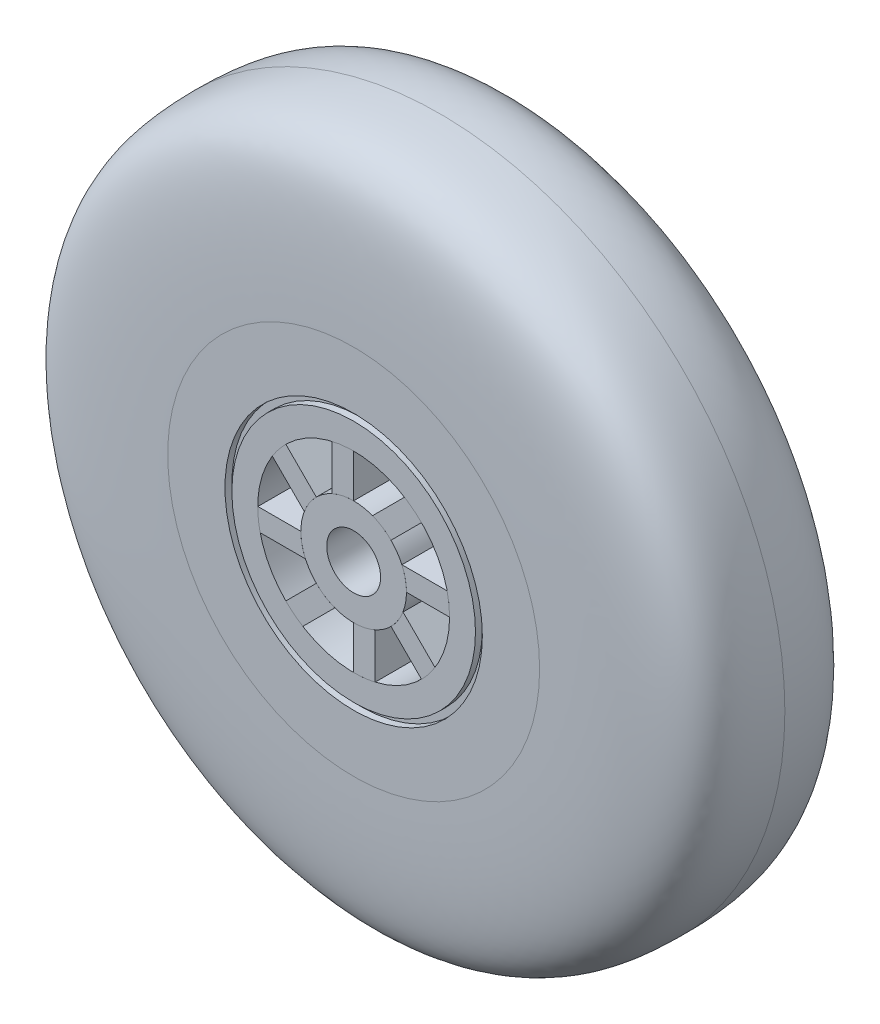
ISO-10303-21;
HEADER;
FILE_DESCRIPTION(('STEP AP214'),'2;1');
FILE_NAME('part.step','',(''),(''),'','','');
FILE_SCHEMA(('AUTOMOTIVE_DESIGN { 1 0 10303 214 1 1 1 1 }'));
ENDSEC;
DATA;
#1=APPLICATION_CONTEXT('core data for automotive mechanical design processes');
#2=APPLICATION_PROTOCOL_DEFINITION('international standard','automotive_design',2000,#1);
#3=PRODUCT_CONTEXT('',#1,'mechanical');
#4=PRODUCT('Part','Part','',(#3));
#5=PRODUCT_RELATED_PRODUCT_CATEGORY('part','',(#4));
#6=PRODUCT_DEFINITION_FORMATION('','',#4);
#7=PRODUCT_DEFINITION_CONTEXT('part definition',#1,'design');
#8=PRODUCT_DEFINITION('design','',#6,#7);
#9=PRODUCT_DEFINITION_SHAPE('','',#8);
#10=(LENGTH_UNIT() NAMED_UNIT(*) SI_UNIT(.MILLI.,.METRE.));
#11=(NAMED_UNIT(*) PLANE_ANGLE_UNIT() SI_UNIT($,.RADIAN.));
#12=(NAMED_UNIT(*) SI_UNIT($,.STERADIAN.) SOLID_ANGLE_UNIT());
#13=UNCERTAINTY_MEASURE_WITH_UNIT(LENGTH_MEASURE(1.E-05),#10,'distance_accuracy_value','');
#14=(GEOMETRIC_REPRESENTATION_CONTEXT(3) GLOBAL_UNCERTAINTY_ASSIGNED_CONTEXT((#13)) GLOBAL_UNIT_ASSIGNED_CONTEXT((#10,
#11,#12)) REPRESENTATION_CONTEXT('',''));
#15=CARTESIAN_POINT('',(0.,0.,0.));
#16=DIRECTION('',(0.,0.,1.));
#17=DIRECTION('',(1.,0.,0.));
#18=AXIS2_PLACEMENT_3D('',#15,#16,#17);
#19=CARTESIAN_POINT('',(0.,0.,0.));
#20=DIRECTION('',(0.,0.,-1.));
#21=DIRECTION('',(1.,0.,0.));
#22=AXIS2_PLACEMENT_3D('',#19,#20,#21);
#23=CYLINDRICAL_SURFACE('',#22,7.77875);
#24=CARTESIAN_POINT('',(0.,0.,-12.7));
#25=DIRECTION('',(0.,0.,-1.));
#26=DIRECTION('',(1.,0.,0.));
#27=AXIS2_PLACEMENT_3D('',#24,#25,#26);
#28=CIRCLE('',#27,7.77875);
#29=CARTESIAN_POINT('',(-3.17500000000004,7.10129048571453,-12.7));
#30=VERTEX_POINT('',#29);
#31=CARTESIAN_POINT('',(0.,7.77875,-12.7));
#32=VERTEX_POINT('',#31);
#33=EDGE_CURVE('E109',#30,#32,#28,.T.);
#34=ORIENTED_EDGE('',*,*,#33,.T.);
#35=DIRECTION('',(0.,0.,-1.));
#36=VECTOR('',#35,1.);
#37=CARTESIAN_POINT('',(0.,7.77875,0.));
#38=LINE('',#37,#36);
#39=CARTESIAN_POINT('',(0.,7.77875,0.));
#40=VERTEX_POINT('',#39);
#41=EDGE_CURVE('E48',#40,#32,#38,.T.);
#42=ORIENTED_EDGE('',*,*,#41,.F.);
#43=CARTESIAN_POINT('',(0.,0.,0.));
#44=DIRECTION('',(0.,0.,-1.));
#45=DIRECTION('',(1.,0.,0.));
#46=AXIS2_PLACEMENT_3D('',#43,#44,#45);
#47=CIRCLE('',#46,7.77875);
#48=CARTESIAN_POINT('',(-3.17500000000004,7.10129048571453,0.));
#49=VERTEX_POINT('',#48);
#50=EDGE_CURVE('E98',#49,#40,#47,.T.);
#51=ORIENTED_EDGE('',*,*,#50,.F.);
#52=DIRECTION('',(0.,0.,-1.));
#53=VECTOR('',#52,1.);
#54=CARTESIAN_POINT('',(-3.17500000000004,7.10129048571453,0.));
#55=LINE('',#54,#53);
#56=EDGE_CURVE('E12',#49,#30,#55,.T.);
#57=ORIENTED_EDGE('',*,*,#56,.T.);
#58=EDGE_LOOP('',(#34,#42,#51,#57));
#59=FACE_BOUND('',#58,.T.);
#60=ADVANCED_FACE('F45',(#59),#23,.F.);
#61=CARTESIAN_POINT('',(-3.17500000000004,7.10129048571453,0.));
#62=DIRECTION('',(-1.,0.,0.));
#63=DIRECTION('',(0.,-1.,0.));
#64=AXIS2_PLACEMENT_3D('',#61,#62,#63);
#65=PLANE('',#64);
#66=DIRECTION('',(0.,-1.,0.));
#67=VECTOR('',#66,1.);
#68=CARTESIAN_POINT('',(-3.17500000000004,7.10129048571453,-12.7));
#69=LINE('',#68,#67);
#70=CARTESIAN_POINT('',(-3.17500000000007,13.7673872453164,-12.7));
#71=VERTEX_POINT('',#70);
#72=EDGE_CURVE('E86',#71,#30,#69,.T.);
#73=ORIENTED_EDGE('',*,*,#72,.T.);
#74=ORIENTED_EDGE('',*,*,#56,.F.);
#75=DIRECTION('',(0.,-1.,0.));
#76=VECTOR('',#75,1.);
#77=CARTESIAN_POINT('',(-3.17500000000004,7.10129048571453,0.));
#78=LINE('',#77,#76);
#79=CARTESIAN_POINT('',(-3.17500000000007,13.7673872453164,0.));
#80=VERTEX_POINT('',#79);
#81=EDGE_CURVE('E63',#80,#49,#78,.T.);
#82=ORIENTED_EDGE('',*,*,#81,.F.);
#83=DIRECTION('',(0.,0.,-1.));
#84=VECTOR('',#83,1.);
#85=CARTESIAN_POINT('',(-3.17500000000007,13.7673872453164,0.));
#86=LINE('',#85,#84);
#87=EDGE_CURVE('E54',#80,#71,#86,.T.);
#88=ORIENTED_EDGE('',*,*,#87,.T.);
#89=EDGE_LOOP('',(#73,#74,#82,#88));
#90=FACE_BOUND('',#89,.T.);
#91=ADVANCED_FACE('F115',(#90),#65,.T.);
#92=CARTESIAN_POINT('',(0.,0.,0.));
#93=DIRECTION('',(0.,0.,-1.));
#94=DIRECTION('',(1.,0.,0.));
#95=AXIS2_PLACEMENT_3D('',#92,#93,#94);
#96=CYLINDRICAL_SURFACE('',#95,14.12875);
#97=CARTESIAN_POINT('',(0.,0.,-12.7));
#98=DIRECTION('',(0.,0.,1.));
#99=DIRECTION('',(1.,0.,0.));
#100=AXIS2_PLACEMENT_3D('',#97,#98,#99);
#101=CIRCLE('',#100,14.12875);
#102=CARTESIAN_POINT('',(0.,14.12875,-12.7));
#103=VERTEX_POINT('',#102);
#104=EDGE_CURVE('E80',#103,#71,#101,.T.);
#105=ORIENTED_EDGE('',*,*,#104,.T.);
#106=ORIENTED_EDGE('',*,*,#87,.F.);
#107=CARTESIAN_POINT('',(0.,0.,0.));
#108=DIRECTION('',(0.,0.,1.));
#109=DIRECTION('',(1.,0.,0.));
#110=AXIS2_PLACEMENT_3D('',#107,#108,#109);
#111=CIRCLE('',#110,14.12875);
#112=CARTESIAN_POINT('',(0.,14.12875,0.));
#113=VERTEX_POINT('',#112);
#114=EDGE_CURVE('E96',#113,#80,#111,.T.);
#115=ORIENTED_EDGE('',*,*,#114,.F.);
#116=DIRECTION('',(0.,0.,-1.));
#117=VECTOR('',#116,1.);
#118=CARTESIAN_POINT('',(0.,14.12875,0.));
#119=LINE('',#118,#117);
#120=EDGE_CURVE('E101',#113,#103,#119,.T.);
#121=ORIENTED_EDGE('',*,*,#120,.T.);
#122=EDGE_LOOP('',(#105,#106,#115,#121));
#123=FACE_BOUND('',#122,.T.);
#124=ADVANCED_FACE('F104',(#123),#96,.T.);
#125=CARTESIAN_POINT('',(0.,7.77875,0.));
#126=DIRECTION('',(1.,0.,0.));
#127=DIRECTION('',(0.,1.,0.));
#128=AXIS2_PLACEMENT_3D('',#125,#126,#127);
#129=PLANE('',#128);
#130=DIRECTION('',(0.,1.,0.));
#131=VECTOR('',#130,1.);
#132=CARTESIAN_POINT('',(0.,7.77875,-12.7));
#133=LINE('',#132,#131);
#134=EDGE_CURVE('E103',#32,#103,#133,.T.);
#135=ORIENTED_EDGE('',*,*,#134,.T.);
#136=ORIENTED_EDGE('',*,*,#120,.F.);
#137=DIRECTION('',(0.,1.,0.));
#138=VECTOR('',#137,1.);
#139=CARTESIAN_POINT('',(0.,7.77875,0.));
#140=LINE('',#139,#138);
#141=EDGE_CURVE('E93',#40,#113,#140,.T.);
#142=ORIENTED_EDGE('',*,*,#141,.F.);
#143=ORIENTED_EDGE('',*,*,#41,.T.);
#144=EDGE_LOOP('',(#135,#136,#142,#143));
#145=FACE_BOUND('',#144,.T.);
#146=ADVANCED_FACE('F102',(#145),#129,.T.);
#147=CARTESIAN_POINT('',(0.,0.,0.));
#148=DIRECTION('',(0.,0.,-1.));
#149=DIRECTION('',(1.,0.,0.));
#150=AXIS2_PLACEMENT_3D('',#147,#148,#149);
#151=PLANE('',#150);
#152=ORIENTED_EDGE('',*,*,#50,.T.);
#153=ORIENTED_EDGE('',*,*,#141,.T.);
#154=ORIENTED_EDGE('',*,*,#114,.T.);
#155=ORIENTED_EDGE('',*,*,#81,.T.);
#156=EDGE_LOOP('',(#152,#153,#154,#155));
#157=FACE_BOUND('',#156,.T.);
#158=ADVANCED_FACE('F94',(#157),#151,.F.);
#159=CARTESIAN_POINT('',(0.,0.,-12.7));
#160=DIRECTION('',(0.,0.,-1.));
#161=DIRECTION('',(1.,0.,0.));
#162=AXIS2_PLACEMENT_3D('',#159,#160,#161);
#163=PLANE('',#162);
#164=ORIENTED_EDGE('',*,*,#33,.F.);
#165=ORIENTED_EDGE('',*,*,#72,.F.);
#166=ORIENTED_EDGE('',*,*,#104,.F.);
#167=ORIENTED_EDGE('',*,*,#134,.F.);
#168=EDGE_LOOP('',(#164,#165,#166,#167));
#169=FACE_BOUND('',#168,.T.);
#170=ADVANCED_FACE('F118',(#169),#163,.T.);
#171=CLOSED_SHELL('',(#60,#91,#124,#146,#158,#170));
#172=MANIFOLD_SOLID_BREP('B2',#171);
#173=CARTESIAN_POINT('',(0.,0.,0.));
#174=DIRECTION('',(0.,0.,-1.));
#175=DIRECTION('',(1.,0.,0.));
#176=AXIS2_PLACEMENT_3D('',#173,#174,#175);
#177=CYLINDRICAL_SURFACE('',#176,7.77875);
#178=CARTESIAN_POINT('',(0.,0.,-12.7));
#179=DIRECTION('',(0.,0.,-1.));
#180=DIRECTION('',(1.,0.,0.));
#181=AXIS2_PLACEMENT_3D('',#178,#179,#180);
#182=CIRCLE('',#181,7.77875);
#183=CARTESIAN_POINT('',(-7.26643468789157,2.77630662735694,-12.7));
#184=VERTEX_POINT('',#183);
#185=CARTESIAN_POINT('',(-5.50040687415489,5.50040687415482,-12.7));
#186=VERTEX_POINT('',#185);
#187=EDGE_CURVE('E242',#184,#186,#182,.T.);
#188=ORIENTED_EDGE('',*,*,#187,.T.);
#189=DIRECTION('',(0.,0.,-1.));
#190=VECTOR('',#189,1.);
#191=CARTESIAN_POINT('',(-5.50040687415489,5.50040687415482,0.));
#192=LINE('',#191,#190);
#193=CARTESIAN_POINT('',(-5.50040687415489,5.50040687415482,0.));
#194=VERTEX_POINT('',#193);
#195=EDGE_CURVE('E181',#194,#186,#192,.T.);
#196=ORIENTED_EDGE('',*,*,#195,.F.);
#197=CARTESIAN_POINT('',(0.,0.,0.));
#198=DIRECTION('',(0.,0.,-1.));
#199=DIRECTION('',(1.,0.,0.));
#200=AXIS2_PLACEMENT_3D('',#197,#198,#199);
#201=CIRCLE('',#200,7.77875);
#202=CARTESIAN_POINT('',(-7.26643468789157,2.77630662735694,0.));
#203=VERTEX_POINT('',#202);
#204=EDGE_CURVE('E231',#203,#194,#201,.T.);
#205=ORIENTED_EDGE('',*,*,#204,.F.);
#206=DIRECTION('',(0.,0.,-1.));
#207=VECTOR('',#206,1.);
#208=CARTESIAN_POINT('',(-7.26643468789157,2.77630662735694,0.));
#209=LINE('',#208,#207);
#210=EDGE_CURVE('E43',#203,#184,#209,.T.);
#211=ORIENTED_EDGE('',*,*,#210,.T.);
#212=EDGE_LOOP('',(#188,#196,#205,#211));
#213=FACE_BOUND('',#212,.T.);
#214=ADVANCED_FACE('F178',(#213),#177,.F.);
#215=CARTESIAN_POINT('',(-7.26643468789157,2.77630662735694,0.));
#216=DIRECTION('',(-0.707106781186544,-0.707106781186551,0.));
#217=DIRECTION('',(0.707106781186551,-0.707106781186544,0.));
#218=AXIS2_PLACEMENT_3D('',#215,#216,#217);
#219=PLANE('',#218);
#220=DIRECTION('',(0.707106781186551,-0.707106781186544,0.));
#221=VECTOR('',#220,1.);
#222=CARTESIAN_POINT('',(-7.26643468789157,2.77630662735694,-12.7));
#223=LINE('',#222,#221);
#224=CARTESIAN_POINT('',(-11.9800769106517,7.48994885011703,-12.7));
#225=VERTEX_POINT('',#224);
#226=EDGE_CURVE('E219',#225,#184,#223,.T.);
#227=ORIENTED_EDGE('',*,*,#226,.T.);
#228=ORIENTED_EDGE('',*,*,#210,.F.);
#229=DIRECTION('',(0.707106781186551,-0.707106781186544,0.));
#230=VECTOR('',#229,1.);
#231=CARTESIAN_POINT('',(-7.26643468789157,2.77630662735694,0.));
#232=LINE('',#231,#230);
#233=CARTESIAN_POINT('',(-11.9800769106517,7.48994885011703,0.));
#234=VERTEX_POINT('',#233);
#235=EDGE_CURVE('E196',#234,#203,#232,.T.);
#236=ORIENTED_EDGE('',*,*,#235,.F.);
#237=DIRECTION('',(0.,0.,-1.));
#238=VECTOR('',#237,1.);
#239=CARTESIAN_POINT('',(-11.9800769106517,7.48994885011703,0.));
#240=LINE('',#239,#238);
#241=EDGE_CURVE('E187',#234,#225,#240,.T.);
#242=ORIENTED_EDGE('',*,*,#241,.T.);
#243=EDGE_LOOP('',(#227,#228,#236,#242));
#244=FACE_BOUND('',#243,.T.);
#245=ADVANCED_FACE('F248',(#244),#219,.T.);
#246=CARTESIAN_POINT('',(0.,0.,0.));
#247=DIRECTION('',(0.,0.,-1.));
#248=DIRECTION('',(1.,0.,0.));
#249=AXIS2_PLACEMENT_3D('',#246,#247,#248);
#250=CYLINDRICAL_SURFACE('',#249,14.12875);
#251=CARTESIAN_POINT('',(0.,0.,-12.7));
#252=DIRECTION('',(0.,0.,1.));
#253=DIRECTION('',(1.,0.,0.));
#254=AXIS2_PLACEMENT_3D('',#251,#252,#253);
#255=CIRCLE('',#254,14.12875);
#256=CARTESIAN_POINT('',(-9.99053493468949,9.99053493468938,-12.7));
#257=VERTEX_POINT('',#256);
#258=EDGE_CURVE('E213',#257,#225,#255,.T.);
#259=ORIENTED_EDGE('',*,*,#258,.T.);
#260=ORIENTED_EDGE('',*,*,#241,.F.);
#261=CARTESIAN_POINT('',(0.,0.,0.));
#262=DIRECTION('',(0.,0.,1.));
#263=DIRECTION('',(1.,0.,0.));
#264=AXIS2_PLACEMENT_3D('',#261,#262,#263);
#265=CIRCLE('',#264,14.12875);
#266=CARTESIAN_POINT('',(-9.99053493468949,9.99053493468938,0.));
#267=VERTEX_POINT('',#266);
#268=EDGE_CURVE('E229',#267,#234,#265,.T.);
#269=ORIENTED_EDGE('',*,*,#268,.F.);
#270=DIRECTION('',(0.,0.,-1.));
#271=VECTOR('',#270,1.);
#272=CARTESIAN_POINT('',(-9.99053493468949,9.99053493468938,0.));
#273=LINE('',#272,#271);
#274=EDGE_CURVE('E234',#267,#257,#273,.T.);
#275=ORIENTED_EDGE('',*,*,#274,.T.);
#276=EDGE_LOOP('',(#259,#260,#269,#275));
#277=FACE_BOUND('',#276,.T.);
#278=ADVANCED_FACE('F237',(#277),#250,.T.);
#279=CARTESIAN_POINT('',(-5.50040687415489,5.50040687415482,0.));
#280=DIRECTION('',(0.707106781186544,0.707106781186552,0.));
#281=DIRECTION('',(-0.707106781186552,0.707106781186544,0.));
#282=AXIS2_PLACEMENT_3D('',#279,#280,#281);
#283=PLANE('',#282);
#284=DIRECTION('',(-0.707106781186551,0.707106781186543,0.));
#285=VECTOR('',#284,1.);
#286=CARTESIAN_POINT('',(-5.50040687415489,5.50040687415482,-12.7));
#287=LINE('',#286,#285);
#288=EDGE_CURVE('E236',#186,#257,#287,.T.);
#289=ORIENTED_EDGE('',*,*,#288,.T.);
#290=ORIENTED_EDGE('',*,*,#274,.F.);
#291=DIRECTION('',(-0.707106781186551,0.707106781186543,0.));
#292=VECTOR('',#291,1.);
#293=CARTESIAN_POINT('',(-5.50040687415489,5.50040687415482,0.));
#294=LINE('',#293,#292);
#295=EDGE_CURVE('E226',#194,#267,#294,.T.);
#296=ORIENTED_EDGE('',*,*,#295,.F.);
#297=ORIENTED_EDGE('',*,*,#195,.T.);
#298=EDGE_LOOP('',(#289,#290,#296,#297));
#299=FACE_BOUND('',#298,.T.);
#300=ADVANCED_FACE('F235',(#299),#283,.T.);
#301=CARTESIAN_POINT('',(0.,0.,0.));
#302=DIRECTION('',(0.,0.,-1.));
#303=DIRECTION('',(1.,0.,0.));
#304=AXIS2_PLACEMENT_3D('',#301,#302,#303);
#305=PLANE('',#304);
#306=ORIENTED_EDGE('',*,*,#204,.T.);
#307=ORIENTED_EDGE('',*,*,#295,.T.);
#308=ORIENTED_EDGE('',*,*,#268,.T.);
#309=ORIENTED_EDGE('',*,*,#235,.T.);
#310=EDGE_LOOP('',(#306,#307,#308,#309));
#311=FACE_BOUND('',#310,.T.);
#312=ADVANCED_FACE('F227',(#311),#305,.F.);
#313=CARTESIAN_POINT('',(0.,0.,-12.7));
#314=DIRECTION('',(0.,0.,-1.));
#315=DIRECTION('',(1.,0.,0.));
#316=AXIS2_PLACEMENT_3D('',#313,#314,#315);
#317=PLANE('',#316);
#318=ORIENTED_EDGE('',*,*,#187,.F.);
#319=ORIENTED_EDGE('',*,*,#226,.F.);
#320=ORIENTED_EDGE('',*,*,#258,.F.);
#321=ORIENTED_EDGE('',*,*,#288,.F.);
#322=EDGE_LOOP('',(#318,#319,#320,#321));
#323=FACE_BOUND('',#322,.T.);
#324=ADVANCED_FACE('F251',(#323),#317,.T.);
#325=CLOSED_SHELL('',(#214,#245,#278,#300,#312,#324));
#326=MANIFOLD_SOLID_BREP('B6',#325);
#327=CARTESIAN_POINT('',(0.,0.,0.));
#328=DIRECTION('',(0.,0.,-1.));
#329=DIRECTION('',(1.,0.,0.));
#330=AXIS2_PLACEMENT_3D('',#327,#328,#329);
#331=CYLINDRICAL_SURFACE('',#330,7.77875);
#332=CARTESIAN_POINT('',(0.,0.,-12.7));
#333=DIRECTION('',(0.,0.,-1.));
#334=DIRECTION('',(1.,0.,0.));
#335=AXIS2_PLACEMENT_3D('',#332,#333,#334);
#336=CIRCLE('',#335,7.77875);
#337=CARTESIAN_POINT('',(-7.10129048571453,-3.17500000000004,-12.7));
#338=VERTEX_POINT('',#337);
#339=CARTESIAN_POINT('',(-7.77875,0.,-12.7));
#340=VERTEX_POINT('',#339);
#341=EDGE_CURVE('E375',#338,#340,#336,.T.);
#342=ORIENTED_EDGE('',*,*,#341,.T.);
#343=DIRECTION('',(0.,0.,-1.));
#344=VECTOR('',#343,1.);
#345=CARTESIAN_POINT('',(-7.77875,0.,0.));
#346=LINE('',#345,#344);
#347=CARTESIAN_POINT('',(-7.77875,0.,0.));
#348=VERTEX_POINT('',#347);
#349=EDGE_CURVE('E314',#348,#340,#346,.T.);
#350=ORIENTED_EDGE('',*,*,#349,.F.);
#351=CARTESIAN_POINT('',(0.,0.,0.));
#352=DIRECTION('',(0.,0.,-1.));
#353=DIRECTION('',(1.,0.,0.));
#354=AXIS2_PLACEMENT_3D('',#351,#352,#353);
#355=CIRCLE('',#354,7.77875);
#356=CARTESIAN_POINT('',(-7.10129048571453,-3.17500000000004,0.));
#357=VERTEX_POINT('',#356);
#358=EDGE_CURVE('E364',#357,#348,#355,.T.);
#359=ORIENTED_EDGE('',*,*,#358,.F.);
#360=DIRECTION('',(0.,0.,-1.));
#361=VECTOR('',#360,1.);
#362=CARTESIAN_POINT('',(-7.10129048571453,-3.17500000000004,0.));
#363=LINE('',#362,#361);
#364=EDGE_CURVE('E176',#357,#338,#363,.T.);
#365=ORIENTED_EDGE('',*,*,#364,.T.);
#366=EDGE_LOOP('',(#342,#350,#359,#365));
#367=FACE_BOUND('',#366,.T.);
#368=ADVANCED_FACE('F311',(#367),#331,.F.);
#369=CARTESIAN_POINT('',(-7.10129048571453,-3.17500000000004,0.));
#370=DIRECTION('',(0.,-1.,0.));
#371=DIRECTION('',(1.,0.,0.));
#372=AXIS2_PLACEMENT_3D('',#369,#370,#371);
#373=PLANE('',#372);
#374=DIRECTION('',(1.,0.,0.));
#375=VECTOR('',#374,1.);
#376=CARTESIAN_POINT('',(-7.10129048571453,-3.17500000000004,-12.7));
#377=LINE('',#376,#375);
#378=CARTESIAN_POINT('',(-13.7673872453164,-3.17500000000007,-12.7));
#379=VERTEX_POINT('',#378);
#380=EDGE_CURVE('E352',#379,#338,#377,.T.);
#381=ORIENTED_EDGE('',*,*,#380,.T.);
#382=ORIENTED_EDGE('',*,*,#364,.F.);
#383=DIRECTION('',(1.,0.,0.));
#384=VECTOR('',#383,1.);
#385=CARTESIAN_POINT('',(-7.10129048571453,-3.17500000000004,0.));
#386=LINE('',#385,#384);
#387=CARTESIAN_POINT('',(-13.7673872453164,-3.17500000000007,0.));
#388=VERTEX_POINT('',#387);
#389=EDGE_CURVE('E329',#388,#357,#386,.T.);
#390=ORIENTED_EDGE('',*,*,#389,.F.);
#391=DIRECTION('',(0.,0.,-1.));
#392=VECTOR('',#391,1.);
#393=CARTESIAN_POINT('',(-13.7673872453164,-3.17500000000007,0.));
#394=LINE('',#393,#392);
#395=EDGE_CURVE('E320',#388,#379,#394,.T.);
#396=ORIENTED_EDGE('',*,*,#395,.T.);
#397=EDGE_LOOP('',(#381,#382,#390,#396));
#398=FACE_BOUND('',#397,.T.);
#399=ADVANCED_FACE('F381',(#398),#373,.T.);
#400=CARTESIAN_POINT('',(0.,0.,0.));
#401=DIRECTION('',(0.,0.,-1.));
#402=DIRECTION('',(1.,0.,0.));
#403=AXIS2_PLACEMENT_3D('',#400,#401,#402);
#404=CYLINDRICAL_SURFACE('',#403,14.12875);
#405=CARTESIAN_POINT('',(0.,0.,-12.7));
#406=DIRECTION('',(0.,0.,1.));
#407=DIRECTION('',(1.,0.,0.));
#408=AXIS2_PLACEMENT_3D('',#405,#406,#407);
#409=CIRCLE('',#408,14.12875);
#410=CARTESIAN_POINT('',(-14.12875,0.,-12.7));
#411=VERTEX_POINT('',#410);
#412=EDGE_CURVE('E346',#411,#379,#409,.T.);
#413=ORIENTED_EDGE('',*,*,#412,.T.);
#414=ORIENTED_EDGE('',*,*,#395,.F.);
#415=CARTESIAN_POINT('',(0.,0.,0.));
#416=DIRECTION('',(0.,0.,1.));
#417=DIRECTION('',(1.,0.,0.));
#418=AXIS2_PLACEMENT_3D('',#415,#416,#417);
#419=CIRCLE('',#418,14.12875);
#420=CARTESIAN_POINT('',(-14.12875,0.,0.));
#421=VERTEX_POINT('',#420);
#422=EDGE_CURVE('E362',#421,#388,#419,.T.);
#423=ORIENTED_EDGE('',*,*,#422,.F.);
#424=DIRECTION('',(0.,0.,-1.));
#425=VECTOR('',#424,1.);
#426=CARTESIAN_POINT('',(-14.12875,0.,0.));
#427=LINE('',#426,#425);
#428=EDGE_CURVE('E367',#421,#411,#427,.T.);
#429=ORIENTED_EDGE('',*,*,#428,.T.);
#430=EDGE_LOOP('',(#413,#414,#423,#429));
#431=FACE_BOUND('',#430,.T.);
#432=ADVANCED_FACE('F370',(#431),#404,.T.);
#433=CARTESIAN_POINT('',(-7.77875,0.,0.));
#434=DIRECTION('',(0.,1.,0.));
#435=DIRECTION('',(-1.,0.,0.));
#436=AXIS2_PLACEMENT_3D('',#433,#434,#435);
#437=PLANE('',#436);
#438=DIRECTION('',(-1.,0.,0.));
#439=VECTOR('',#438,1.);
#440=CARTESIAN_POINT('',(-7.77875,0.,-12.7));
#441=LINE('',#440,#439);
#442=EDGE_CURVE('E369',#340,#411,#441,.T.);
#443=ORIENTED_EDGE('',*,*,#442,.T.);
#444=ORIENTED_EDGE('',*,*,#428,.F.);
#445=DIRECTION('',(-1.,0.,0.));
#446=VECTOR('',#445,1.);
#447=CARTESIAN_POINT('',(-7.77875,0.,0.));
#448=LINE('',#447,#446);
#449=EDGE_CURVE('E359',#348,#421,#448,.T.);
#450=ORIENTED_EDGE('',*,*,#449,.F.);
#451=ORIENTED_EDGE('',*,*,#349,.T.);
#452=EDGE_LOOP('',(#443,#444,#450,#451));
#453=FACE_BOUND('',#452,.T.);
#454=ADVANCED_FACE('F368',(#453),#437,.T.);
#455=CARTESIAN_POINT('',(0.,0.,0.));
#456=DIRECTION('',(0.,0.,-1.));
#457=DIRECTION('',(1.,0.,0.));
#458=AXIS2_PLACEMENT_3D('',#455,#456,#457);
#459=PLANE('',#458);
#460=ORIENTED_EDGE('',*,*,#358,.T.);
#461=ORIENTED_EDGE('',*,*,#449,.T.);
#462=ORIENTED_EDGE('',*,*,#422,.T.);
#463=ORIENTED_EDGE('',*,*,#389,.T.);
#464=EDGE_LOOP('',(#460,#461,#462,#463));
#465=FACE_BOUND('',#464,.T.);
#466=ADVANCED_FACE('F360',(#465),#459,.F.);
#467=CARTESIAN_POINT('',(0.,0.,-12.7));
#468=DIRECTION('',(0.,0.,-1.));
#469=DIRECTION('',(1.,0.,0.));
#470=AXIS2_PLACEMENT_3D('',#467,#468,#469);
#471=PLANE('',#470);
#472=ORIENTED_EDGE('',*,*,#341,.F.);
#473=ORIENTED_EDGE('',*,*,#380,.F.);
#474=ORIENTED_EDGE('',*,*,#412,.F.);
#475=ORIENTED_EDGE('',*,*,#442,.F.);
#476=EDGE_LOOP('',(#472,#473,#474,#475));
#477=FACE_BOUND('',#476,.T.);
#478=ADVANCED_FACE('F384',(#477),#471,.T.);
#479=CLOSED_SHELL('',(#368,#399,#432,#454,#466,#478));
#480=MANIFOLD_SOLID_BREP('B37',#479);
#481=CARTESIAN_POINT('',(0.,0.,0.));
#482=DIRECTION('',(0.,0.,-1.));
#483=DIRECTION('',(1.,0.,0.));
#484=AXIS2_PLACEMENT_3D('',#481,#482,#483);
#485=CYLINDRICAL_SURFACE('',#484,7.77875);
#486=CARTESIAN_POINT('',(0.,0.,-12.7));
#487=DIRECTION('',(0.,0.,-1.));
#488=DIRECTION('',(1.,0.,0.));
#489=AXIS2_PLACEMENT_3D('',#486,#487,#488);
#490=CIRCLE('',#489,7.77875);
#491=CARTESIAN_POINT('',(-2.77630662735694,-7.26643468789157,-12.7));
#492=VERTEX_POINT('',#491);
#493=CARTESIAN_POINT('',(-5.50040687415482,-5.50040687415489,-12.7));
#494=VERTEX_POINT('',#493);
#495=EDGE_CURVE('E508',#492,#494,#490,.T.);
#496=ORIENTED_EDGE('',*,*,#495,.T.);
#497=DIRECTION('',(0.,0.,-1.));
#498=VECTOR('',#497,1.);
#499=CARTESIAN_POINT('',(-5.50040687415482,-5.50040687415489,0.));
#500=LINE('',#499,#498);
#501=CARTESIAN_POINT('',(-5.50040687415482,-5.50040687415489,0.));
#502=VERTEX_POINT('',#501);
#503=EDGE_CURVE('E447',#502,#494,#500,.T.);
#504=ORIENTED_EDGE('',*,*,#503,.F.);
#505=CARTESIAN_POINT('',(0.,0.,0.));
#506=DIRECTION('',(0.,0.,-1.));
#507=DIRECTION('',(1.,0.,0.));
#508=AXIS2_PLACEMENT_3D('',#505,#506,#507);
#509=CIRCLE('',#508,7.77875);
#510=CARTESIAN_POINT('',(-2.77630662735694,-7.26643468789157,0.));
#511=VERTEX_POINT('',#510);
#512=EDGE_CURVE('E497',#511,#502,#509,.T.);
#513=ORIENTED_EDGE('',*,*,#512,.F.);
#514=DIRECTION('',(0.,0.,-1.));
#515=VECTOR('',#514,1.);
#516=CARTESIAN_POINT('',(-2.77630662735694,-7.26643468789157,0.));
#517=LINE('',#516,#515);
#518=EDGE_CURVE('E309',#511,#492,#517,.T.);
#519=ORIENTED_EDGE('',*,*,#518,.T.);
#520=EDGE_LOOP('',(#496,#504,#513,#519));
#521=FACE_BOUND('',#520,.T.);
#522=ADVANCED_FACE('F444',(#521),#485,.F.);
#523=CARTESIAN_POINT('',(-2.77630662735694,-7.26643468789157,0.));
#524=DIRECTION('',(0.707106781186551,-0.707106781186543,0.));
#525=DIRECTION('',(0.707106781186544,0.707106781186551,0.));
#526=AXIS2_PLACEMENT_3D('',#523,#524,#525);
#527=PLANE('',#526);
#528=DIRECTION('',(0.707106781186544,0.707106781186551,0.));
#529=VECTOR('',#528,1.);
#530=CARTESIAN_POINT('',(-2.77630662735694,-7.26643468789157,-12.7));
#531=LINE('',#530,#529);
#532=CARTESIAN_POINT('',(-7.48994885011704,-11.9800769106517,-12.7));
#533=VERTEX_POINT('',#532);
#534=EDGE_CURVE('E485',#533,#492,#531,.T.);
#535=ORIENTED_EDGE('',*,*,#534,.T.);
#536=ORIENTED_EDGE('',*,*,#518,.F.);
#537=DIRECTION('',(0.707106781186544,0.707106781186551,0.));
#538=VECTOR('',#537,1.);
#539=CARTESIAN_POINT('',(-2.77630662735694,-7.26643468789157,0.));
#540=LINE('',#539,#538);
#541=CARTESIAN_POINT('',(-7.48994885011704,-11.9800769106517,0.));
#542=VERTEX_POINT('',#541);
#543=EDGE_CURVE('E462',#542,#511,#540,.T.);
#544=ORIENTED_EDGE('',*,*,#543,.F.);
#545=DIRECTION('',(0.,0.,-1.));
#546=VECTOR('',#545,1.);
#547=CARTESIAN_POINT('',(-7.48994885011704,-11.9800769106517,0.));
#548=LINE('',#547,#546);
#549=EDGE_CURVE('E453',#542,#533,#548,.T.);
#550=ORIENTED_EDGE('',*,*,#549,.T.);
#551=EDGE_LOOP('',(#535,#536,#544,#550));
#552=FACE_BOUND('',#551,.T.);
#553=ADVANCED_FACE('F514',(#552),#527,.T.);
#554=CARTESIAN_POINT('',(0.,0.,0.));
#555=DIRECTION('',(0.,0.,-1.));
#556=DIRECTION('',(1.,0.,0.));
#557=AXIS2_PLACEMENT_3D('',#554,#555,#556);
#558=CYLINDRICAL_SURFACE('',#557,14.12875);
#559=CARTESIAN_POINT('',(0.,0.,-12.7));
#560=DIRECTION('',(0.,0.,1.));
#561=DIRECTION('',(1.,0.,0.));
#562=AXIS2_PLACEMENT_3D('',#559,#560,#561);
#563=CIRCLE('',#562,14.12875);
#564=CARTESIAN_POINT('',(-9.99053493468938,-9.99053493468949,-12.7));
#565=VERTEX_POINT('',#564);
#566=EDGE_CURVE('E479',#565,#533,#563,.T.);
#567=ORIENTED_EDGE('',*,*,#566,.T.);
#568=ORIENTED_EDGE('',*,*,#549,.F.);
#569=CARTESIAN_POINT('',(0.,0.,0.));
#570=DIRECTION('',(0.,0.,1.));
#571=DIRECTION('',(1.,0.,0.));
#572=AXIS2_PLACEMENT_3D('',#569,#570,#571);
#573=CIRCLE('',#572,14.12875);
#574=CARTESIAN_POINT('',(-9.99053493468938,-9.99053493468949,0.));
#575=VERTEX_POINT('',#574);
#576=EDGE_CURVE('E495',#575,#542,#573,.T.);
#577=ORIENTED_EDGE('',*,*,#576,.F.);
#578=DIRECTION('',(0.,0.,-1.));
#579=VECTOR('',#578,1.);
#580=CARTESIAN_POINT('',(-9.99053493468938,-9.99053493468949,0.));
#581=LINE('',#580,#579);
#582=EDGE_CURVE('E500',#575,#565,#581,.T.);
#583=ORIENTED_EDGE('',*,*,#582,.T.);
#584=EDGE_LOOP('',(#567,#568,#577,#583));
#585=FACE_BOUND('',#584,.T.);
#586=ADVANCED_FACE('F503',(#585),#558,.T.);
#587=CARTESIAN_POINT('',(-5.50040687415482,-5.50040687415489,0.));
#588=DIRECTION('',(-0.707106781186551,0.707106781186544,0.));
#589=DIRECTION('',(-0.707106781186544,-0.707106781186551,0.));
#590=AXIS2_PLACEMENT_3D('',#587,#588,#589);
#591=PLANE('',#590);
#592=DIRECTION('',(-0.707106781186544,-0.707106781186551,0.));
#593=VECTOR('',#592,1.);
#594=CARTESIAN_POINT('',(-5.50040687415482,-5.50040687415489,-12.7));
#595=LINE('',#594,#593);
#596=EDGE_CURVE('E502',#494,#565,#595,.T.);
#597=ORIENTED_EDGE('',*,*,#596,.T.);
#598=ORIENTED_EDGE('',*,*,#582,.F.);
#599=DIRECTION('',(-0.707106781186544,-0.707106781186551,0.));
#600=VECTOR('',#599,1.);
#601=CARTESIAN_POINT('',(-5.50040687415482,-5.50040687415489,0.));
#602=LINE('',#601,#600);
#603=EDGE_CURVE('E492',#502,#575,#602,.T.);
#604=ORIENTED_EDGE('',*,*,#603,.F.);
#605=ORIENTED_EDGE('',*,*,#503,.T.);
#606=EDGE_LOOP('',(#597,#598,#604,#605));
#607=FACE_BOUND('',#606,.T.);
#608=ADVANCED_FACE('F501',(#607),#591,.T.);
#609=CARTESIAN_POINT('',(0.,0.,0.));
#610=DIRECTION('',(0.,0.,-1.));
#611=DIRECTION('',(1.,0.,0.));
#612=AXIS2_PLACEMENT_3D('',#609,#610,#611);
#613=PLANE('',#612);
#614=ORIENTED_EDGE('',*,*,#512,.T.);
#615=ORIENTED_EDGE('',*,*,#603,.T.);
#616=ORIENTED_EDGE('',*,*,#576,.T.);
#617=ORIENTED_EDGE('',*,*,#543,.T.);
#618=EDGE_LOOP('',(#614,#615,#616,#617));
#619=FACE_BOUND('',#618,.T.);
#620=ADVANCED_FACE('F493',(#619),#613,.F.);
#621=CARTESIAN_POINT('',(0.,0.,-12.7));
#622=DIRECTION('',(0.,0.,-1.));
#623=DIRECTION('',(1.,0.,0.));
#624=AXIS2_PLACEMENT_3D('',#621,#622,#623);
#625=PLANE('',#624);
#626=ORIENTED_EDGE('',*,*,#495,.F.);
#627=ORIENTED_EDGE('',*,*,#534,.F.);
#628=ORIENTED_EDGE('',*,*,#566,.F.);
#629=ORIENTED_EDGE('',*,*,#596,.F.);
#630=EDGE_LOOP('',(#626,#627,#628,#629));
#631=FACE_BOUND('',#630,.T.);
#632=ADVANCED_FACE('F517',(#631),#625,.T.);
#633=CLOSED_SHELL('',(#522,#553,#586,#608,#620,#632));
#634=MANIFOLD_SOLID_BREP('B170',#633);
#635=CARTESIAN_POINT('',(0.,0.,0.));
#636=DIRECTION('',(0.,0.,-1.));
#637=DIRECTION('',(1.,0.,0.));
#638=AXIS2_PLACEMENT_3D('',#635,#636,#637);
#639=CYLINDRICAL_SURFACE('',#638,7.77875);
#640=CARTESIAN_POINT('',(0.,0.,-12.7));
#641=DIRECTION('',(0.,0.,-1.));
#642=DIRECTION('',(1.,0.,0.));
#643=AXIS2_PLACEMENT_3D('',#640,#641,#642);
#644=CIRCLE('',#643,7.77875);
#645=CARTESIAN_POINT('',(3.17500000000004,-7.10129048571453,-12.7));
#646=VERTEX_POINT('',#645);
#647=CARTESIAN_POINT('',(0.,-7.77875,-12.7));
#648=VERTEX_POINT('',#647);
#649=EDGE_CURVE('E641',#646,#648,#644,.T.);
#650=ORIENTED_EDGE('',*,*,#649,.T.);
#651=DIRECTION('',(0.,0.,-1.));
#652=VECTOR('',#651,1.);
#653=CARTESIAN_POINT('',(0.,-7.77875,0.));
#654=LINE('',#653,#652);
#655=CARTESIAN_POINT('',(0.,-7.77875,0.));
#656=VERTEX_POINT('',#655);
#657=EDGE_CURVE('E580',#656,#648,#654,.T.);
#658=ORIENTED_EDGE('',*,*,#657,.F.);
#659=CARTESIAN_POINT('',(0.,0.,0.));
#660=DIRECTION('',(0.,0.,-1.));
#661=DIRECTION('',(1.,0.,0.));
#662=AXIS2_PLACEMENT_3D('',#659,#660,#661);
#663=CIRCLE('',#662,7.77875);
#664=CARTESIAN_POINT('',(3.17500000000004,-7.10129048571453,0.));
#665=VERTEX_POINT('',#664);
#666=EDGE_CURVE('E630',#665,#656,#663,.T.);
#667=ORIENTED_EDGE('',*,*,#666,.F.);
#668=DIRECTION('',(0.,0.,-1.));
#669=VECTOR('',#668,1.);
#670=CARTESIAN_POINT('',(3.17500000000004,-7.10129048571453,0.));
#671=LINE('',#670,#669);
#672=EDGE_CURVE('E442',#665,#646,#671,.T.);
#673=ORIENTED_EDGE('',*,*,#672,.T.);
#674=EDGE_LOOP('',(#650,#658,#667,#673));
#675=FACE_BOUND('',#674,.T.);
#676=ADVANCED_FACE('F577',(#675),#639,.F.);
#677=CARTESIAN_POINT('',(3.17500000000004,-7.10129048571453,0.));
#678=DIRECTION('',(1.,0.,0.));
#679=DIRECTION('',(0.,1.,0.));
#680=AXIS2_PLACEMENT_3D('',#677,#678,#679);
#681=PLANE('',#680);
#682=DIRECTION('',(0.,1.,0.));
#683=VECTOR('',#682,1.);
#684=CARTESIAN_POINT('',(3.17500000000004,-7.10129048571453,-12.7));
#685=LINE('',#684,#683);
#686=CARTESIAN_POINT('',(3.17500000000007,-13.7673872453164,-12.7));
#687=VERTEX_POINT('',#686);
#688=EDGE_CURVE('E618',#687,#646,#685,.T.);
#689=ORIENTED_EDGE('',*,*,#688,.T.);
#690=ORIENTED_EDGE('',*,*,#672,.F.);
#691=DIRECTION('',(0.,1.,0.));
#692=VECTOR('',#691,1.);
#693=CARTESIAN_POINT('',(3.17500000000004,-7.10129048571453,0.));
#694=LINE('',#693,#692);
#695=CARTESIAN_POINT('',(3.17500000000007,-13.7673872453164,0.));
#696=VERTEX_POINT('',#695);
#697=EDGE_CURVE('E595',#696,#665,#694,.T.);
#698=ORIENTED_EDGE('',*,*,#697,.F.);
#699=DIRECTION('',(0.,0.,-1.));
#700=VECTOR('',#699,1.);
#701=CARTESIAN_POINT('',(3.17500000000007,-13.7673872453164,0.));
#702=LINE('',#701,#700);
#703=EDGE_CURVE('E586',#696,#687,#702,.T.);
#704=ORIENTED_EDGE('',*,*,#703,.T.);
#705=EDGE_LOOP('',(#689,#690,#698,#704));
#706=FACE_BOUND('',#705,.T.);
#707=ADVANCED_FACE('F647',(#706),#681,.T.);
#708=CARTESIAN_POINT('',(0.,0.,0.));
#709=DIRECTION('',(0.,0.,-1.));
#710=DIRECTION('',(1.,0.,0.));
#711=AXIS2_PLACEMENT_3D('',#708,#709,#710);
#712=CYLINDRICAL_SURFACE('',#711,14.12875);
#713=CARTESIAN_POINT('',(0.,0.,-12.7));
#714=DIRECTION('',(0.,0.,1.));
#715=DIRECTION('',(1.,0.,0.));
#716=AXIS2_PLACEMENT_3D('',#713,#714,#715);
#717=CIRCLE('',#716,14.12875);
#718=CARTESIAN_POINT('',(0.,-14.12875,-12.7));
#719=VERTEX_POINT('',#718);
#720=EDGE_CURVE('E612',#719,#687,#717,.T.);
#721=ORIENTED_EDGE('',*,*,#720,.T.);
#722=ORIENTED_EDGE('',*,*,#703,.F.);
#723=CARTESIAN_POINT('',(0.,0.,0.));
#724=DIRECTION('',(0.,0.,1.));
#725=DIRECTION('',(1.,0.,0.));
#726=AXIS2_PLACEMENT_3D('',#723,#724,#725);
#727=CIRCLE('',#726,14.12875);
#728=CARTESIAN_POINT('',(0.,-14.12875,0.));
#729=VERTEX_POINT('',#728);
#730=EDGE_CURVE('E628',#729,#696,#727,.T.);
#731=ORIENTED_EDGE('',*,*,#730,.F.);
#732=DIRECTION('',(0.,0.,-1.));
#733=VECTOR('',#732,1.);
#734=CARTESIAN_POINT('',(0.,-14.12875,0.));
#735=LINE('',#734,#733);
#736=EDGE_CURVE('E633',#729,#719,#735,.T.);
#737=ORIENTED_EDGE('',*,*,#736,.T.);
#738=EDGE_LOOP('',(#721,#722,#731,#737));
#739=FACE_BOUND('',#738,.T.);
#740=ADVANCED_FACE('F636',(#739),#712,.T.);
#741=CARTESIAN_POINT('',(0.,-7.77875,0.));
#742=DIRECTION('',(-1.,0.,0.));
#743=DIRECTION('',(0.,-1.,0.));
#744=AXIS2_PLACEMENT_3D('',#741,#742,#743);
#745=PLANE('',#744);
#746=DIRECTION('',(0.,-1.,0.));
#747=VECTOR('',#746,1.);
#748=CARTESIAN_POINT('',(0.,-7.77875,-12.7));
#749=LINE('',#748,#747);
#750=EDGE_CURVE('E635',#648,#719,#749,.T.);
#751=ORIENTED_EDGE('',*,*,#750,.T.);
#752=ORIENTED_EDGE('',*,*,#736,.F.);
#753=DIRECTION('',(0.,-1.,0.));
#754=VECTOR('',#753,1.);
#755=CARTESIAN_POINT('',(0.,-7.77875,0.));
#756=LINE('',#755,#754);
#757=EDGE_CURVE('E625',#656,#729,#756,.T.);
#758=ORIENTED_EDGE('',*,*,#757,.F.);
#759=ORIENTED_EDGE('',*,*,#657,.T.);
#760=EDGE_LOOP('',(#751,#752,#758,#759));
#761=FACE_BOUND('',#760,.T.);
#762=ADVANCED_FACE('F634',(#761),#745,.T.);
#763=CARTESIAN_POINT('',(0.,0.,0.));
#764=DIRECTION('',(0.,0.,-1.));
#765=DIRECTION('',(1.,0.,0.));
#766=AXIS2_PLACEMENT_3D('',#763,#764,#765);
#767=PLANE('',#766);
#768=ORIENTED_EDGE('',*,*,#666,.T.);
#769=ORIENTED_EDGE('',*,*,#757,.T.);
#770=ORIENTED_EDGE('',*,*,#730,.T.);
#771=ORIENTED_EDGE('',*,*,#697,.T.);
#772=EDGE_LOOP('',(#768,#769,#770,#771));
#773=FACE_BOUND('',#772,.T.);
#774=ADVANCED_FACE('F626',(#773),#767,.F.);
#775=CARTESIAN_POINT('',(0.,0.,-12.7));
#776=DIRECTION('',(0.,0.,-1.));
#777=DIRECTION('',(1.,0.,0.));
#778=AXIS2_PLACEMENT_3D('',#775,#776,#777);
#779=PLANE('',#778);
#780=ORIENTED_EDGE('',*,*,#649,.F.);
#781=ORIENTED_EDGE('',*,*,#688,.F.);
#782=ORIENTED_EDGE('',*,*,#720,.F.);
#783=ORIENTED_EDGE('',*,*,#750,.F.);
#784=EDGE_LOOP('',(#780,#781,#782,#783));
#785=FACE_BOUND('',#784,.T.);
#786=ADVANCED_FACE('F650',(#785),#779,.T.);
#787=CLOSED_SHELL('',(#676,#707,#740,#762,#774,#786));
#788=MANIFOLD_SOLID_BREP('B303',#787);
#789=CARTESIAN_POINT('',(0.,0.,0.));
#790=DIRECTION('',(0.,0.,-1.));
#791=DIRECTION('',(1.,0.,0.));
#792=AXIS2_PLACEMENT_3D('',#789,#790,#791);
#793=CYLINDRICAL_SURFACE('',#792,7.77875);
#794=CARTESIAN_POINT('',(0.,0.,-12.7));
#795=DIRECTION('',(0.,0.,-1.));
#796=DIRECTION('',(1.,0.,0.));
#797=AXIS2_PLACEMENT_3D('',#794,#795,#796);
#798=CIRCLE('',#797,7.77875);
#799=CARTESIAN_POINT('',(7.26643468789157,-2.77630662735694,-12.7));
#800=VERTEX_POINT('',#799);
#801=CARTESIAN_POINT('',(5.50040687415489,-5.50040687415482,-12.7));
#802=VERTEX_POINT('',#801);
#803=EDGE_CURVE('E774',#800,#802,#798,.T.);
#804=ORIENTED_EDGE('',*,*,#803,.T.);
#805=DIRECTION('',(0.,0.,-1.));
#806=VECTOR('',#805,1.);
#807=CARTESIAN_POINT('',(5.50040687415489,-5.50040687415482,0.));
#808=LINE('',#807,#806);
#809=CARTESIAN_POINT('',(5.50040687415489,-5.50040687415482,0.));
#810=VERTEX_POINT('',#809);
#811=EDGE_CURVE('E713',#810,#802,#808,.T.);
#812=ORIENTED_EDGE('',*,*,#811,.F.);
#813=CARTESIAN_POINT('',(0.,0.,0.));
#814=DIRECTION('',(0.,0.,-1.));
#815=DIRECTION('',(1.,0.,0.));
#816=AXIS2_PLACEMENT_3D('',#813,#814,#815);
#817=CIRCLE('',#816,7.77875);
#818=CARTESIAN_POINT('',(7.26643468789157,-2.77630662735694,0.));
#819=VERTEX_POINT('',#818);
#820=EDGE_CURVE('E763',#819,#810,#817,.T.);
#821=ORIENTED_EDGE('',*,*,#820,.F.);
#822=DIRECTION('',(0.,0.,-1.));
#823=VECTOR('',#822,1.);
#824=CARTESIAN_POINT('',(7.26643468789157,-2.77630662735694,0.));
#825=LINE('',#824,#823);
#826=EDGE_CURVE('E575',#819,#800,#825,.T.);
#827=ORIENTED_EDGE('',*,*,#826,.T.);
#828=EDGE_LOOP('',(#804,#812,#821,#827));
#829=FACE_BOUND('',#828,.T.);
#830=ADVANCED_FACE('F710',(#829),#793,.F.);
#831=CARTESIAN_POINT('',(7.26643468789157,-2.77630662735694,0.));
#832=DIRECTION('',(0.707106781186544,0.707106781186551,0.));
#833=DIRECTION('',(-0.707106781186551,0.707106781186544,0.));
#834=AXIS2_PLACEMENT_3D('',#831,#832,#833);
#835=PLANE('',#834);
#836=DIRECTION('',(-0.707106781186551,0.707106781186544,0.));
#837=VECTOR('',#836,1.);
#838=CARTESIAN_POINT('',(7.26643468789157,-2.77630662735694,-12.7));
#839=LINE('',#838,#837);
#840=CARTESIAN_POINT('',(11.9800769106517,-7.48994885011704,-12.7));
#841=VERTEX_POINT('',#840);
#842=EDGE_CURVE('E751',#841,#800,#839,.T.);
#843=ORIENTED_EDGE('',*,*,#842,.T.);
#844=ORIENTED_EDGE('',*,*,#826,.F.);
#845=DIRECTION('',(-0.707106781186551,0.707106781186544,0.));
#846=VECTOR('',#845,1.);
#847=CARTESIAN_POINT('',(7.26643468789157,-2.77630662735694,0.));
#848=LINE('',#847,#846);
#849=CARTESIAN_POINT('',(11.9800769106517,-7.48994885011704,0.));
#850=VERTEX_POINT('',#849);
#851=EDGE_CURVE('E728',#850,#819,#848,.T.);
#852=ORIENTED_EDGE('',*,*,#851,.F.);
#853=DIRECTION('',(0.,0.,-1.));
#854=VECTOR('',#853,1.);
#855=CARTESIAN_POINT('',(11.9800769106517,-7.48994885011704,0.));
#856=LINE('',#855,#854);
#857=EDGE_CURVE('E719',#850,#841,#856,.T.);
#858=ORIENTED_EDGE('',*,*,#857,.T.);
#859=EDGE_LOOP('',(#843,#844,#852,#858));
#860=FACE_BOUND('',#859,.T.);
#861=ADVANCED_FACE('F780',(#860),#835,.T.);
#862=CARTESIAN_POINT('',(0.,0.,0.));
#863=DIRECTION('',(0.,0.,-1.));
#864=DIRECTION('',(1.,0.,0.));
#865=AXIS2_PLACEMENT_3D('',#862,#863,#864);
#866=CYLINDRICAL_SURFACE('',#865,14.12875);
#867=CARTESIAN_POINT('',(0.,0.,-12.7));
#868=DIRECTION('',(0.,0.,1.));
#869=DIRECTION('',(1.,0.,0.));
#870=AXIS2_PLACEMENT_3D('',#867,#868,#869);
#871=CIRCLE('',#870,14.12875);
#872=CARTESIAN_POINT('',(9.99053493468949,-9.99053493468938,-12.7));
#873=VERTEX_POINT('',#872);
#874=EDGE_CURVE('E745',#873,#841,#871,.T.);
#875=ORIENTED_EDGE('',*,*,#874,.T.);
#876=ORIENTED_EDGE('',*,*,#857,.F.);
#877=CARTESIAN_POINT('',(0.,0.,0.));
#878=DIRECTION('',(0.,0.,1.));
#879=DIRECTION('',(1.,0.,0.));
#880=AXIS2_PLACEMENT_3D('',#877,#878,#879);
#881=CIRCLE('',#880,14.12875);
#882=CARTESIAN_POINT('',(9.99053493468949,-9.99053493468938,0.));
#883=VERTEX_POINT('',#882);
#884=EDGE_CURVE('E761',#883,#850,#881,.T.);
#885=ORIENTED_EDGE('',*,*,#884,.F.);
#886=DIRECTION('',(0.,0.,-1.));
#887=VECTOR('',#886,1.);
#888=CARTESIAN_POINT('',(9.99053493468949,-9.99053493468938,0.));
#889=LINE('',#888,#887);
#890=EDGE_CURVE('E766',#883,#873,#889,.T.);
#891=ORIENTED_EDGE('',*,*,#890,.T.);
#892=EDGE_LOOP('',(#875,#876,#885,#891));
#893=FACE_BOUND('',#892,.T.);
#894=ADVANCED_FACE('F769',(#893),#866,.T.);
#895=CARTESIAN_POINT('',(5.50040687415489,-5.50040687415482,0.));
#896=DIRECTION('',(-0.707106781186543,-0.707106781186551,0.));
#897=DIRECTION('',(0.707106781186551,-0.707106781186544,0.));
#898=AXIS2_PLACEMENT_3D('',#895,#896,#897);
#899=PLANE('',#898);
#900=DIRECTION('',(0.707106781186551,-0.707106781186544,0.));
#901=VECTOR('',#900,1.);
#902=CARTESIAN_POINT('',(5.50040687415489,-5.50040687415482,-12.7));
#903=LINE('',#902,#901);
#904=EDGE_CURVE('E768',#802,#873,#903,.T.);
#905=ORIENTED_EDGE('',*,*,#904,.T.);
#906=ORIENTED_EDGE('',*,*,#890,.F.);
#907=DIRECTION('',(0.707106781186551,-0.707106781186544,0.));
#908=VECTOR('',#907,1.);
#909=CARTESIAN_POINT('',(5.50040687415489,-5.50040687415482,0.));
#910=LINE('',#909,#908);
#911=EDGE_CURVE('E758',#810,#883,#910,.T.);
#912=ORIENTED_EDGE('',*,*,#911,.F.);
#913=ORIENTED_EDGE('',*,*,#811,.T.);
#914=EDGE_LOOP('',(#905,#906,#912,#913));
#915=FACE_BOUND('',#914,.T.);
#916=ADVANCED_FACE('F767',(#915),#899,.T.);
#917=CARTESIAN_POINT('',(0.,0.,0.));
#918=DIRECTION('',(0.,0.,-1.));
#919=DIRECTION('',(1.,0.,0.));
#920=AXIS2_PLACEMENT_3D('',#917,#918,#919);
#921=PLANE('',#920);
#922=ORIENTED_EDGE('',*,*,#820,.T.);
#923=ORIENTED_EDGE('',*,*,#911,.T.);
#924=ORIENTED_EDGE('',*,*,#884,.T.);
#925=ORIENTED_EDGE('',*,*,#851,.T.);
#926=EDGE_LOOP('',(#922,#923,#924,#925));
#927=FACE_BOUND('',#926,.T.);
#928=ADVANCED_FACE('F759',(#927),#921,.F.);
#929=CARTESIAN_POINT('',(0.,0.,-12.7));
#930=DIRECTION('',(0.,0.,-1.));
#931=DIRECTION('',(1.,0.,0.));
#932=AXIS2_PLACEMENT_3D('',#929,#930,#931);
#933=PLANE('',#932);
#934=ORIENTED_EDGE('',*,*,#803,.F.);
#935=ORIENTED_EDGE('',*,*,#842,.F.);
#936=ORIENTED_EDGE('',*,*,#874,.F.);
#937=ORIENTED_EDGE('',*,*,#904,.F.);
#938=EDGE_LOOP('',(#934,#935,#936,#937));
#939=FACE_BOUND('',#938,.T.);
#940=ADVANCED_FACE('F783',(#939),#933,.T.);
#941=CLOSED_SHELL('',(#830,#861,#894,#916,#928,#940));
#942=MANIFOLD_SOLID_BREP('B436',#941);
#943=CARTESIAN_POINT('',(0.,0.,0.));
#944=DIRECTION('',(0.,0.,-1.));
#945=DIRECTION('',(1.,0.,0.));
#946=AXIS2_PLACEMENT_3D('',#943,#944,#945);
#947=CYLINDRICAL_SURFACE('',#946,7.77875);
#948=CARTESIAN_POINT('',(0.,0.,-12.7));
#949=DIRECTION('',(0.,0.,-1.));
#950=DIRECTION('',(1.,0.,0.));
#951=AXIS2_PLACEMENT_3D('',#948,#949,#950);
#952=CIRCLE('',#951,7.77875);
#953=CARTESIAN_POINT('',(7.10129048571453,3.17500000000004,-12.7));
#954=VERTEX_POINT('',#953);
#955=CARTESIAN_POINT('',(7.77875,0.,-12.7));
#956=VERTEX_POINT('',#955);
#957=EDGE_CURVE('E907',#954,#956,#952,.T.);
#958=ORIENTED_EDGE('',*,*,#957,.T.);
#959=DIRECTION('',(0.,0.,-1.));
#960=VECTOR('',#959,1.);
#961=CARTESIAN_POINT('',(7.77875,0.,0.));
#962=LINE('',#961,#960);
#963=CARTESIAN_POINT('',(7.77875,0.,0.));
#964=VERTEX_POINT('',#963);
#965=EDGE_CURVE('E846',#964,#956,#962,.T.);
#966=ORIENTED_EDGE('',*,*,#965,.F.);
#967=CARTESIAN_POINT('',(0.,0.,0.));
#968=DIRECTION('',(0.,0.,-1.));
#969=DIRECTION('',(1.,0.,0.));
#970=AXIS2_PLACEMENT_3D('',#967,#968,#969);
#971=CIRCLE('',#970,7.77875);
#972=CARTESIAN_POINT('',(7.10129048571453,3.17500000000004,0.));
#973=VERTEX_POINT('',#972);
#974=EDGE_CURVE('E896',#973,#964,#971,.T.);
#975=ORIENTED_EDGE('',*,*,#974,.F.);
#976=DIRECTION('',(0.,0.,-1.));
#977=VECTOR('',#976,1.);
#978=CARTESIAN_POINT('',(7.10129048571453,3.17500000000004,0.));
#979=LINE('',#978,#977);
#980=EDGE_CURVE('E708',#973,#954,#979,.T.);
#981=ORIENTED_EDGE('',*,*,#980,.T.);
#982=EDGE_LOOP('',(#958,#966,#975,#981));
#983=FACE_BOUND('',#982,.T.);
#984=ADVANCED_FACE('F843',(#983),#947,.F.);
#985=CARTESIAN_POINT('',(7.10129048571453,3.17500000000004,0.));
#986=DIRECTION('',(0.,1.,0.));
#987=DIRECTION('',(-1.,0.,0.));
#988=AXIS2_PLACEMENT_3D('',#985,#986,#987);
#989=PLANE('',#988);
#990=DIRECTION('',(-1.,0.,0.));
#991=VECTOR('',#990,1.);
#992=CARTESIAN_POINT('',(7.10129048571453,3.17500000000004,-12.7));
#993=LINE('',#992,#991);
#994=CARTESIAN_POINT('',(13.7673872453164,3.17500000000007,-12.7));
#995=VERTEX_POINT('',#994);
#996=EDGE_CURVE('E884',#995,#954,#993,.T.);
#997=ORIENTED_EDGE('',*,*,#996,.T.);
#998=ORIENTED_EDGE('',*,*,#980,.F.);
#999=DIRECTION('',(-1.,0.,0.));
#1000=VECTOR('',#999,1.);
#1001=CARTESIAN_POINT('',(7.10129048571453,3.17500000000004,0.));
#1002=LINE('',#1001,#1000);
#1003=CARTESIAN_POINT('',(13.7673872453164,3.17500000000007,0.));
#1004=VERTEX_POINT('',#1003);
#1005=EDGE_CURVE('E861',#1004,#973,#1002,.T.);
#1006=ORIENTED_EDGE('',*,*,#1005,.F.);
#1007=DIRECTION('',(0.,0.,-1.));
#1008=VECTOR('',#1007,1.);
#1009=CARTESIAN_POINT('',(13.7673872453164,3.17500000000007,0.));
#1010=LINE('',#1009,#1008);
#1011=EDGE_CURVE('E852',#1004,#995,#1010,.T.);
#1012=ORIENTED_EDGE('',*,*,#1011,.T.);
#1013=EDGE_LOOP('',(#997,#998,#1006,#1012));
#1014=FACE_BOUND('',#1013,.T.);
#1015=ADVANCED_FACE('F913',(#1014),#989,.T.);
#1016=CARTESIAN_POINT('',(0.,0.,0.));
#1017=DIRECTION('',(0.,0.,-1.));
#1018=DIRECTION('',(1.,0.,0.));
#1019=AXIS2_PLACEMENT_3D('',#1016,#1017,#1018);
#1020=CYLINDRICAL_SURFACE('',#1019,14.12875);
#1021=CARTESIAN_POINT('',(0.,0.,-12.7));
#1022=DIRECTION('',(0.,0.,1.));
#1023=DIRECTION('',(1.,0.,0.));
#1024=AXIS2_PLACEMENT_3D('',#1021,#1022,#1023);
#1025=CIRCLE('',#1024,14.12875);
#1026=CARTESIAN_POINT('',(14.12875,0.,-12.7));
#1027=VERTEX_POINT('',#1026);
#1028=EDGE_CURVE('E878',#1027,#995,#1025,.T.);
#1029=ORIENTED_EDGE('',*,*,#1028,.T.);
#1030=ORIENTED_EDGE('',*,*,#1011,.F.);
#1031=CARTESIAN_POINT('',(0.,0.,0.));
#1032=DIRECTION('',(0.,0.,1.));
#1033=DIRECTION('',(1.,0.,0.));
#1034=AXIS2_PLACEMENT_3D('',#1031,#1032,#1033);
#1035=CIRCLE('',#1034,14.12875);
#1036=CARTESIAN_POINT('',(14.12875,0.,0.));
#1037=VERTEX_POINT('',#1036);
#1038=EDGE_CURVE('E894',#1037,#1004,#1035,.T.);
#1039=ORIENTED_EDGE('',*,*,#1038,.F.);
#1040=DIRECTION('',(0.,0.,-1.));
#1041=VECTOR('',#1040,1.);
#1042=CARTESIAN_POINT('',(14.12875,0.,0.));
#1043=LINE('',#1042,#1041);
#1044=EDGE_CURVE('E899',#1037,#1027,#1043,.T.);
#1045=ORIENTED_EDGE('',*,*,#1044,.T.);
#1046=EDGE_LOOP('',(#1029,#1030,#1039,#1045));
#1047=FACE_BOUND('',#1046,.T.);
#1048=ADVANCED_FACE('F902',(#1047),#1020,.T.);
#1049=CARTESIAN_POINT('',(7.77875,0.,0.));
#1050=DIRECTION('',(0.,-1.,0.));
#1051=DIRECTION('',(1.,0.,0.));
#1052=AXIS2_PLACEMENT_3D('',#1049,#1050,#1051);
#1053=PLANE('',#1052);
#1054=DIRECTION('',(1.,0.,0.));
#1055=VECTOR('',#1054,1.);
#1056=CARTESIAN_POINT('',(7.77875,0.,-12.7));
#1057=LINE('',#1056,#1055);
#1058=EDGE_CURVE('E901',#956,#1027,#1057,.T.);
#1059=ORIENTED_EDGE('',*,*,#1058,.T.);
#1060=ORIENTED_EDGE('',*,*,#1044,.F.);
#1061=DIRECTION('',(1.,0.,0.));
#1062=VECTOR('',#1061,1.);
#1063=CARTESIAN_POINT('',(7.77875,0.,0.));
#1064=LINE('',#1063,#1062);
#1065=EDGE_CURVE('E891',#964,#1037,#1064,.T.);
#1066=ORIENTED_EDGE('',*,*,#1065,.F.);
#1067=ORIENTED_EDGE('',*,*,#965,.T.);
#1068=EDGE_LOOP('',(#1059,#1060,#1066,#1067));
#1069=FACE_BOUND('',#1068,.T.);
#1070=ADVANCED_FACE('F900',(#1069),#1053,.T.);
#1071=CARTESIAN_POINT('',(0.,0.,0.));
#1072=DIRECTION('',(0.,0.,-1.));
#1073=DIRECTION('',(1.,0.,0.));
#1074=AXIS2_PLACEMENT_3D('',#1071,#1072,#1073);
#1075=PLANE('',#1074);
#1076=ORIENTED_EDGE('',*,*,#974,.T.);
#1077=ORIENTED_EDGE('',*,*,#1065,.T.);
#1078=ORIENTED_EDGE('',*,*,#1038,.T.);
#1079=ORIENTED_EDGE('',*,*,#1005,.T.);
#1080=EDGE_LOOP('',(#1076,#1077,#1078,#1079));
#1081=FACE_BOUND('',#1080,.T.);
#1082=ADVANCED_FACE('F892',(#1081),#1075,.F.);
#1083=CARTESIAN_POINT('',(0.,0.,-12.7));
#1084=DIRECTION('',(0.,0.,-1.));
#1085=DIRECTION('',(1.,0.,0.));
#1086=AXIS2_PLACEMENT_3D('',#1083,#1084,#1085);
#1087=PLANE('',#1086);
#1088=ORIENTED_EDGE('',*,*,#957,.F.);
#1089=ORIENTED_EDGE('',*,*,#996,.F.);
#1090=ORIENTED_EDGE('',*,*,#1028,.F.);
#1091=ORIENTED_EDGE('',*,*,#1058,.F.);
#1092=EDGE_LOOP('',(#1088,#1089,#1090,#1091));
#1093=FACE_BOUND('',#1092,.T.);
#1094=ADVANCED_FACE('F916',(#1093),#1087,.T.);
#1095=CLOSED_SHELL('',(#984,#1015,#1048,#1070,#1082,#1094));
#1096=MANIFOLD_SOLID_BREP('B569',#1095);
#1097=CARTESIAN_POINT('',(0.,0.,0.));
#1098=DIRECTION('',(0.,0.,-1.));
#1099=DIRECTION('',(1.,0.,0.));
#1100=AXIS2_PLACEMENT_3D('',#1097,#1098,#1099);
#1101=CYLINDRICAL_SURFACE('',#1100,7.77875);
#1102=CARTESIAN_POINT('',(0.,0.,-12.7));
#1103=DIRECTION('',(0.,0.,-1.));
#1104=DIRECTION('',(1.,0.,0.));
#1105=AXIS2_PLACEMENT_3D('',#1102,#1103,#1104);
#1106=CIRCLE('',#1105,7.77875);
#1107=CARTESIAN_POINT('',(2.77630662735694,7.26643468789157,-12.7));
#1108=VERTEX_POINT('',#1107);
#1109=CARTESIAN_POINT('',(5.50040687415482,5.50040687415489,-12.7));
#1110=VERTEX_POINT('',#1109);
#1111=EDGE_CURVE('E1038',#1108,#1110,#1106,.T.);
#1112=ORIENTED_EDGE('',*,*,#1111,.T.);
#1113=DIRECTION('',(0.,0.,-1.));
#1114=VECTOR('',#1113,1.);
#1115=CARTESIAN_POINT('',(5.50040687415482,5.50040687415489,0.));
#1116=LINE('',#1115,#1114);
#1117=CARTESIAN_POINT('',(5.50040687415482,5.50040687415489,0.));
#1118=VERTEX_POINT('',#1117);
#1119=EDGE_CURVE('E977',#1118,#1110,#1116,.T.);
#1120=ORIENTED_EDGE('',*,*,#1119,.F.);
#1121=CARTESIAN_POINT('',(0.,0.,0.));
#1122=DIRECTION('',(0.,0.,-1.));
#1123=DIRECTION('',(1.,0.,0.));
#1124=AXIS2_PLACEMENT_3D('',#1121,#1122,#1123);
#1125=CIRCLE('',#1124,7.77875);
#1126=CARTESIAN_POINT('',(2.77630662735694,7.26643468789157,0.));
#1127=VERTEX_POINT('',#1126);
#1128=EDGE_CURVE('E1027',#1127,#1118,#1125,.T.);
#1129=ORIENTED_EDGE('',*,*,#1128,.F.);
#1130=DIRECTION('',(0.,0.,-1.));
#1131=VECTOR('',#1130,1.);
#1132=CARTESIAN_POINT('',(2.77630662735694,7.26643468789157,0.));
#1133=LINE('',#1132,#1131);
#1134=EDGE_CURVE('E841',#1127,#1108,#1133,.T.);
#1135=ORIENTED_EDGE('',*,*,#1134,.T.);
#1136=EDGE_LOOP('',(#1112,#1120,#1129,#1135));
#1137=FACE_BOUND('',#1136,.T.);
#1138=ADVANCED_FACE('F974',(#1137),#1101,.F.);
#1139=CARTESIAN_POINT('',(2.77630662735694,7.26643468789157,0.));
#1140=DIRECTION('',(-0.707106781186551,0.707106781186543,0.));
#1141=DIRECTION('',(-0.707106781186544,-0.707106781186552,0.));
#1142=AXIS2_PLACEMENT_3D('',#1139,#1140,#1141);
#1143=PLANE('',#1142);
#1144=DIRECTION('',(-0.707106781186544,-0.707106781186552,0.));
#1145=VECTOR('',#1144,1.);
#1146=CARTESIAN_POINT('',(2.77630662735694,7.26643468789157,-12.7));
#1147=LINE('',#1146,#1145);
#1148=CARTESIAN_POINT('',(7.48994885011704,11.9800769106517,-12.7));
#1149=VERTEX_POINT('',#1148);
#1150=EDGE_CURVE('E1015',#1149,#1108,#1147,.T.);
#1151=ORIENTED_EDGE('',*,*,#1150,.T.);
#1152=ORIENTED_EDGE('',*,*,#1134,.F.);
#1153=DIRECTION('',(-0.707106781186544,-0.707106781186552,0.));
#1154=VECTOR('',#1153,1.);
#1155=CARTESIAN_POINT('',(2.77630662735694,7.26643468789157,0.));
#1156=LINE('',#1155,#1154);
#1157=CARTESIAN_POINT('',(7.48994885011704,11.9800769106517,0.));
#1158=VERTEX_POINT('',#1157);
#1159=EDGE_CURVE('E992',#1158,#1127,#1156,.T.);
#1160=ORIENTED_EDGE('',*,*,#1159,.F.);
#1161=DIRECTION('',(0.,0.,-1.));
#1162=VECTOR('',#1161,1.);
#1163=CARTESIAN_POINT('',(7.48994885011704,11.9800769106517,0.));
#1164=LINE('',#1163,#1162);
#1165=EDGE_CURVE('E983',#1158,#1149,#1164,.T.);
#1166=ORIENTED_EDGE('',*,*,#1165,.T.);
#1167=EDGE_LOOP('',(#1151,#1152,#1160,#1166));
#1168=FACE_BOUND('',#1167,.T.);
#1169=ADVANCED_FACE('F1044',(#1168),#1143,.T.);
#1170=CARTESIAN_POINT('',(0.,0.,0.));
#1171=DIRECTION('',(0.,0.,-1.));
#1172=DIRECTION('',(1.,0.,0.));
#1173=AXIS2_PLACEMENT_3D('',#1170,#1171,#1172);
#1174=CYLINDRICAL_SURFACE('',#1173,14.12875);
#1175=CARTESIAN_POINT('',(0.,0.,-12.7));
#1176=DIRECTION('',(0.,0.,1.));
#1177=DIRECTION('',(1.,0.,0.));
#1178=AXIS2_PLACEMENT_3D('',#1175,#1176,#1177);
#1179=CIRCLE('',#1178,14.12875);
#1180=CARTESIAN_POINT('',(9.99053493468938,9.99053493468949,-12.7));
#1181=VERTEX_POINT('',#1180);
#1182=EDGE_CURVE('E1009',#1181,#1149,#1179,.T.);
#1183=ORIENTED_EDGE('',*,*,#1182,.T.);
#1184=ORIENTED_EDGE('',*,*,#1165,.F.);
#1185=CARTESIAN_POINT('',(0.,0.,0.));
#1186=DIRECTION('',(0.,0.,1.));
#1187=DIRECTION('',(1.,0.,0.));
#1188=AXIS2_PLACEMENT_3D('',#1185,#1186,#1187);
#1189=CIRCLE('',#1188,14.12875);
#1190=CARTESIAN_POINT('',(9.99053493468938,9.99053493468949,0.));
#1191=VERTEX_POINT('',#1190);
#1192=EDGE_CURVE('E1025',#1191,#1158,#1189,.T.);
#1193=ORIENTED_EDGE('',*,*,#1192,.F.);
#1194=DIRECTION('',(0.,0.,-1.));
#1195=VECTOR('',#1194,1.);
#1196=CARTESIAN_POINT('',(9.99053493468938,9.99053493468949,0.));
#1197=LINE('',#1196,#1195);
#1198=EDGE_CURVE('E1030',#1191,#1181,#1197,.T.);
#1199=ORIENTED_EDGE('',*,*,#1198,.T.);
#1200=EDGE_LOOP('',(#1183,#1184,#1193,#1199));
#1201=FACE_BOUND('',#1200,.T.);
#1202=ADVANCED_FACE('F1033',(#1201),#1174,.T.);
#1203=CARTESIAN_POINT('',(5.50040687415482,5.50040687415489,0.));
#1204=DIRECTION('',(0.707106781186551,-0.707106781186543,0.));
#1205=DIRECTION('',(0.707106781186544,0.707106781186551,0.));
#1206=AXIS2_PLACEMENT_3D('',#1203,#1204,#1205);
#1207=PLANE('',#1206);
#1208=DIRECTION('',(0.707106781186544,0.707106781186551,0.));
#1209=VECTOR('',#1208,1.);
#1210=CARTESIAN_POINT('',(5.50040687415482,5.50040687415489,-12.7));
#1211=LINE('',#1210,#1209);
#1212=EDGE_CURVE('E1032',#1110,#1181,#1211,.T.);
#1213=ORIENTED_EDGE('',*,*,#1212,.T.);
#1214=ORIENTED_EDGE('',*,*,#1198,.F.);
#1215=DIRECTION('',(0.707106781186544,0.707106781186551,0.));
#1216=VECTOR('',#1215,1.);
#1217=CARTESIAN_POINT('',(5.50040687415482,5.50040687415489,0.));
#1218=LINE('',#1217,#1216);
#1219=EDGE_CURVE('E1022',#1118,#1191,#1218,.T.);
#1220=ORIENTED_EDGE('',*,*,#1219,.F.);
#1221=ORIENTED_EDGE('',*,*,#1119,.T.);
#1222=EDGE_LOOP('',(#1213,#1214,#1220,#1221));
#1223=FACE_BOUND('',#1222,.T.);
#1224=ADVANCED_FACE('F1031',(#1223),#1207,.T.);
#1225=CARTESIAN_POINT('',(0.,0.,0.));
#1226=DIRECTION('',(0.,0.,-1.));
#1227=DIRECTION('',(1.,0.,0.));
#1228=AXIS2_PLACEMENT_3D('',#1225,#1226,#1227);
#1229=PLANE('',#1228);
#1230=ORIENTED_EDGE('',*,*,#1128,.T.);
#1231=ORIENTED_EDGE('',*,*,#1219,.T.);
#1232=ORIENTED_EDGE('',*,*,#1192,.T.);
#1233=ORIENTED_EDGE('',*,*,#1159,.T.);
#1234=EDGE_LOOP('',(#1230,#1231,#1232,#1233));
#1235=FACE_BOUND('',#1234,.T.);
#1236=ADVANCED_FACE('F1023',(#1235),#1229,.F.);
#1237=CARTESIAN_POINT('',(0.,0.,-12.7));
#1238=DIRECTION('',(0.,0.,-1.));
#1239=DIRECTION('',(1.,0.,0.));
#1240=AXIS2_PLACEMENT_3D('',#1237,#1238,#1239);
#1241=PLANE('',#1240);
#1242=ORIENTED_EDGE('',*,*,#1111,.F.);
#1243=ORIENTED_EDGE('',*,*,#1150,.F.);
#1244=ORIENTED_EDGE('',*,*,#1182,.F.);
#1245=ORIENTED_EDGE('',*,*,#1212,.F.);
#1246=EDGE_LOOP('',(#1242,#1243,#1244,#1245));
#1247=FACE_BOUND('',#1246,.T.);
#1248=ADVANCED_FACE('F1047',(#1247),#1241,.T.);
#1249=CLOSED_SHELL('',(#1138,#1169,#1202,#1224,#1236,#1248));
#1250=MANIFOLD_SOLID_BREP('B702',#1249);
#1251=CARTESIAN_POINT('',(0.,50.8,0.));
#1252=CARTESIAN_POINT('',(0.,50.8,-12.7));
#1253=CARTESIAN_POINT('',(0.,27.384375,-12.7));
#1254=(BOUNDED_CURVE() B_SPLINE_CURVE(2,(#1251,#1252,#1253),.UNSPECIFIED.,.F.,
.F.) B_SPLINE_CURVE_WITH_KNOTS((3,3),(0.,1.),
.UNSPECIFIED.) CURVE() GEOMETRIC_REPRESENTATION_ITEM() RATIONAL_B_SPLINE_CURVE((1.,
2.07291666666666,1.)) REPRESENTATION_ITEM(''));
#1255=CARTESIAN_POINT('',(0.,0.,-12.7));
#1256=DIRECTION('',(0.,0.,-1.));
#1257=AXIS1_PLACEMENT('',#1255,#1256);
#1258=SURFACE_OF_REVOLUTION('',#1254,#1257);
#1259=CARTESIAN_POINT('',(0.,0.,-12.7));
#1260=DIRECTION('',(0.,0.,1.));
#1261=DIRECTION('',(1.,0.,0.));
#1262=AXIS2_PLACEMENT_3D('',#1259,#1260,#1261);
#1263=CIRCLE('',#1262,27.384375);
#1264=CARTESIAN_POINT('',(27.384375,0.,-12.7));
#1265=VERTEX_POINT('',#1264);
#1266=EDGE_CURVE('E1134',#1265,#1265,#1263,.T.);
#1267=ORIENTED_EDGE('',*,*,#1266,.T.);
#1268=EDGE_LOOP('',(#1267));
#1269=FACE_BOUND('',#1268,.T.);
#1270=CARTESIAN_POINT('',(0.,0.,0.));
#1271=DIRECTION('',(0.,0.,1.));
#1272=DIRECTION('',(1.,0.,0.));
#1273=AXIS2_PLACEMENT_3D('',#1270,#1271,#1272);
#1274=CIRCLE('',#1273,50.8);
#1275=CARTESIAN_POINT('',(50.8,0.,0.));
#1276=VERTEX_POINT('',#1275);
#1277=EDGE_CURVE('E973',#1276,#1276,#1274,.T.);
#1278=ORIENTED_EDGE('',*,*,#1277,.F.);
#1279=EDGE_LOOP('',(#1278));
#1280=FACE_BOUND('',#1279,.T.);
#1281=ADVANCED_FACE('F1105',(#1269,#1280),#1258,.T.);
#1282=CARTESIAN_POINT('',(0.,50.8,0.));
#1283=DIRECTION('',(0.,0.,-1.));
#1284=DIRECTION('',(1.,0.,0.));
#1285=AXIS2_PLACEMENT_3D('',#1282,#1283,#1284);
#1286=PLANE('',#1285);
#1287=ORIENTED_EDGE('',*,*,#1277,.T.);
#1288=EDGE_LOOP('',(#1287));
#1289=FACE_BOUND('',#1288,.T.);
#1290=CARTESIAN_POINT('',(0.,0.,0.));
#1291=DIRECTION('',(0.,0.,1.));
#1292=DIRECTION('',(1.,0.,0.));
#1293=AXIS2_PLACEMENT_3D('',#1290,#1291,#1292);
#1294=CIRCLE('',#1293,14.12875);
#1295=CARTESIAN_POINT('',(14.12875,0.,0.));
#1296=VERTEX_POINT('',#1295);
#1297=EDGE_CURVE('E1112',#1296,#1296,#1294,.T.);
#1298=ORIENTED_EDGE('',*,*,#1297,.F.);
#1299=EDGE_LOOP('',(#1298));
#1300=FACE_BOUND('',#1299,.T.);
#1301=ADVANCED_FACE('F1158',(#1289,#1300),#1286,.F.);
#1302=CARTESIAN_POINT('',(0.,0.,-12.7));
#1303=DIRECTION('',(0.,0.,-1.));
#1304=DIRECTION('',(1.,0.,0.));
#1305=AXIS2_PLACEMENT_3D('',#1302,#1303,#1304);
#1306=CYLINDRICAL_SURFACE('',#1305,14.12875);
#1307=ORIENTED_EDGE('',*,*,#1297,.T.);
#1308=EDGE_LOOP('',(#1307));
#1309=FACE_BOUND('',#1308,.T.);
#1310=CARTESIAN_POINT('',(0.,0.,-12.7));
#1311=DIRECTION('',(0.,0.,1.));
#1312=DIRECTION('',(1.,0.,0.));
#1313=AXIS2_PLACEMENT_3D('',#1310,#1311,#1312);
#1314=CIRCLE('',#1313,14.12875);
#1315=CARTESIAN_POINT('',(14.12875,0.,-12.7));
#1316=VERTEX_POINT('',#1315);
#1317=EDGE_CURVE('E1116',#1316,#1316,#1314,.T.);
#1318=ORIENTED_EDGE('',*,*,#1317,.F.);
#1319=EDGE_LOOP('',(#1318));
#1320=FACE_BOUND('',#1319,.T.);
#1321=ADVANCED_FACE('F1162',(#1309,#1320),#1306,.F.);
#1322=CARTESIAN_POINT('',(0.,17.93875,-12.7));
#1323=DIRECTION('',(0.,0.,1.));
#1324=DIRECTION('',(-1.,0.,0.));
#1325=AXIS2_PLACEMENT_3D('',#1322,#1323,#1324);
#1326=PLANE('',#1325);
#1327=ORIENTED_EDGE('',*,*,#1317,.T.);
#1328=EDGE_LOOP('',(#1327));
#1329=FACE_BOUND('',#1328,.T.);
#1330=CARTESIAN_POINT('',(0.,0.,-12.7));
#1331=DIRECTION('',(0.,0.,1.));
#1332=DIRECTION('',(1.,0.,0.));
#1333=AXIS2_PLACEMENT_3D('',#1330,#1331,#1332);
#1334=CIRCLE('',#1333,17.93875);
#1335=CARTESIAN_POINT('',(17.93875,0.,-12.7));
#1336=VERTEX_POINT('',#1335);
#1337=EDGE_CURVE('E1120',#1336,#1336,#1334,.T.);
#1338=ORIENTED_EDGE('',*,*,#1337,.F.);
#1339=EDGE_LOOP('',(#1338));
#1340=FACE_BOUND('',#1339,.T.);
#1341=ADVANCED_FACE('F1166',(#1329,#1340),#1326,.F.);
#1342=CARTESIAN_POINT('',(0.,0.,-12.7));
#1343=DIRECTION('',(0.,0.,-1.));
#1344=DIRECTION('',(1.,0.,0.));
#1345=AXIS2_PLACEMENT_3D('',#1342,#1343,#1344);
#1346=CYLINDRICAL_SURFACE('',#1345,17.93875);
#1347=ORIENTED_EDGE('',*,*,#1337,.T.);
#1348=EDGE_LOOP('',(#1347));
#1349=FACE_BOUND('',#1348,.T.);
#1350=CARTESIAN_POINT('',(0.,0.,-11.684));
#1351=DIRECTION('',(0.,0.,1.));
#1352=DIRECTION('',(1.,0.,0.));
#1353=AXIS2_PLACEMENT_3D('',#1350,#1351,#1352);
#1354=CIRCLE('',#1353,17.93875);
#1355=CARTESIAN_POINT('',(17.93875,0.,-11.684));
#1356=VERTEX_POINT('',#1355);
#1357=EDGE_CURVE('E1125',#1356,#1356,#1354,.T.);
#1358=ORIENTED_EDGE('',*,*,#1357,.F.);
#1359=EDGE_LOOP('',(#1358));
#1360=FACE_BOUND('',#1359,.T.);
#1361=ADVANCED_FACE('F1172',(#1349,#1360),#1346,.T.);
#1362=CARTESIAN_POINT('',(0.,18.95475,-11.684));
#1363=DIRECTION('',(0.,0.,1.));
#1364=DIRECTION('',(-1.,0.,0.));
#1365=AXIS2_PLACEMENT_3D('',#1362,#1363,#1364);
#1366=PLANE('',#1365);
#1367=ORIENTED_EDGE('',*,*,#1357,.T.);
#1368=EDGE_LOOP('',(#1367));
#1369=FACE_BOUND('',#1368,.T.);
#1370=CARTESIAN_POINT('',(0.,0.,-11.684));
#1371=DIRECTION('',(0.,0.,1.));
#1372=DIRECTION('',(1.,0.,0.));
#1373=AXIS2_PLACEMENT_3D('',#1370,#1371,#1372);
#1374=CIRCLE('',#1373,18.95475);
#1375=CARTESIAN_POINT('',(18.95475,0.,-11.684));
#1376=VERTEX_POINT('',#1375);
#1377=EDGE_CURVE('E1128',#1376,#1376,#1374,.T.);
#1378=ORIENTED_EDGE('',*,*,#1377,.F.);
#1379=EDGE_LOOP('',(#1378));
#1380=FACE_BOUND('',#1379,.T.);
#1381=ADVANCED_FACE('F1154',(#1369,#1380),#1366,.F.);
#1382=CARTESIAN_POINT('',(0.,0.,-12.7));
#1383=DIRECTION('',(0.,0.,-1.));
#1384=DIRECTION('',(1.,0.,0.));
#1385=AXIS2_PLACEMENT_3D('',#1382,#1383,#1384);
#1386=CYLINDRICAL_SURFACE('',#1385,18.95475);
#1387=ORIENTED_EDGE('',*,*,#1377,.T.);
#1388=EDGE_LOOP('',(#1387));
#1389=FACE_BOUND('',#1388,.T.);
#1390=CARTESIAN_POINT('',(0.,0.,-12.7));
#1391=DIRECTION('',(0.,0.,1.));
#1392=DIRECTION('',(1.,0.,0.));
#1393=AXIS2_PLACEMENT_3D('',#1390,#1391,#1392);
#1394=CIRCLE('',#1393,18.95475);
#1395=CARTESIAN_POINT('',(18.95475,0.,-12.7));
#1396=VERTEX_POINT('',#1395);
#1397=EDGE_CURVE('E1131',#1396,#1396,#1394,.T.);
#1398=ORIENTED_EDGE('',*,*,#1397,.F.);
#1399=EDGE_LOOP('',(#1398));
#1400=FACE_BOUND('',#1399,.T.);
#1401=ADVANCED_FACE('F1148',(#1389,#1400),#1386,.F.);
#1402=CARTESIAN_POINT('',(0.,27.384375,-12.7));
#1403=DIRECTION('',(0.,0.,1.));
#1404=DIRECTION('',(-1.,0.,0.));
#1405=AXIS2_PLACEMENT_3D('',#1402,#1403,#1404);
#1406=PLANE('',#1405);
#1407=ORIENTED_EDGE('',*,*,#1397,.T.);
#1408=EDGE_LOOP('',(#1407));
#1409=FACE_BOUND('',#1408,.T.);
#1410=ORIENTED_EDGE('',*,*,#1266,.F.);
#1411=EDGE_LOOP('',(#1410));
#1412=FACE_BOUND('',#1411,.T.);
#1413=ADVANCED_FACE('F1146',(#1409,#1412),#1406,.F.);
#1414=CLOSED_SHELL('',(#1281,#1301,#1321,#1341,#1361,#1381,#1401,#1413));
#1415=MANIFOLD_SOLID_BREP('B835',#1414);
#1416=CARTESIAN_POINT('',(0.,0.,-12.7));
#1417=DIRECTION('',(0.,0.,-1.));
#1418=DIRECTION('',(1.,0.,0.));
#1419=AXIS2_PLACEMENT_3D('',#1416,#1417,#1418);
#1420=CYLINDRICAL_SURFACE('',#1419,3.96875);
#1421=CARTESIAN_POINT('',(0.,0.,0.));
#1422=DIRECTION('',(0.,0.,1.));
#1423=DIRECTION('',(1.,0.,0.));
#1424=AXIS2_PLACEMENT_3D('',#1421,#1422,#1423);
#1425=CIRCLE('',#1424,3.96875);
#1426=CARTESIAN_POINT('',(3.96875,0.,0.));
#1427=VERTEX_POINT('',#1426);
#1428=EDGE_CURVE('E1257',#1427,#1427,#1425,.T.);
#1429=ORIENTED_EDGE('',*,*,#1428,.T.);
#1430=EDGE_LOOP('',(#1429));
#1431=FACE_BOUND('',#1430,.T.);
#1432=CARTESIAN_POINT('',(0.,0.,-12.7));
#1433=DIRECTION('',(0.,0.,1.));
#1434=DIRECTION('',(1.,0.,0.));
#1435=AXIS2_PLACEMENT_3D('',#1432,#1433,#1434);
#1436=CIRCLE('',#1435,3.96875);
#1437=CARTESIAN_POINT('',(3.96875,0.,-12.7));
#1438=VERTEX_POINT('',#1437);
#1439=EDGE_CURVE('E1104',#1438,#1438,#1436,.T.);
#1440=ORIENTED_EDGE('',*,*,#1439,.F.);
#1441=EDGE_LOOP('',(#1440));
#1442=FACE_BOUND('',#1441,.T.);
#1443=ADVANCED_FACE('F1243',(#1431,#1442),#1420,.F.);
#1444=CARTESIAN_POINT('',(0.,3.96875,-12.7));
#1445=DIRECTION('',(0.,0.,1.));
#1446=DIRECTION('',(-1.,0.,0.));
#1447=AXIS2_PLACEMENT_3D('',#1444,#1445,#1446);
#1448=PLANE('',#1447);
#1449=ORIENTED_EDGE('',*,*,#1439,.T.);
#1450=EDGE_LOOP('',(#1449));
#1451=FACE_BOUND('',#1450,.T.);
#1452=CARTESIAN_POINT('',(0.,0.,-12.7));
#1453=DIRECTION('',(0.,0.,1.));
#1454=DIRECTION('',(1.,0.,0.));
#1455=AXIS2_PLACEMENT_3D('',#1452,#1453,#1454);
#1456=CIRCLE('',#1455,7.77875);
#1457=CARTESIAN_POINT('',(7.77875,0.,-12.7));
#1458=VERTEX_POINT('',#1457);
#1459=EDGE_CURVE('E1249',#1458,#1458,#1456,.T.);
#1460=ORIENTED_EDGE('',*,*,#1459,.F.);
#1461=EDGE_LOOP('',(#1460));
#1462=FACE_BOUND('',#1461,.T.);
#1463=ADVANCED_FACE('F1273',(#1451,#1462),#1448,.F.);
#1464=CARTESIAN_POINT('',(0.,0.,-12.7));
#1465=DIRECTION('',(0.,0.,-1.));
#1466=DIRECTION('',(1.,0.,0.));
#1467=AXIS2_PLACEMENT_3D('',#1464,#1465,#1466);
#1468=CYLINDRICAL_SURFACE('',#1467,7.77875);
#1469=ORIENTED_EDGE('',*,*,#1459,.T.);
#1470=EDGE_LOOP('',(#1469));
#1471=FACE_BOUND('',#1470,.T.);
#1472=CARTESIAN_POINT('',(0.,0.,0.));
#1473=DIRECTION('',(0.,0.,1.));
#1474=DIRECTION('',(1.,0.,0.));
#1475=AXIS2_PLACEMENT_3D('',#1472,#1473,#1474);
#1476=CIRCLE('',#1475,7.77875);
#1477=CARTESIAN_POINT('',(7.77875,0.,0.));
#1478=VERTEX_POINT('',#1477);
#1479=EDGE_CURVE('E1253',#1478,#1478,#1476,.T.);
#1480=ORIENTED_EDGE('',*,*,#1479,.F.);
#1481=EDGE_LOOP('',(#1480));
#1482=FACE_BOUND('',#1481,.T.);
#1483=ADVANCED_FACE('F1267',(#1471,#1482),#1468,.T.);
#1484=CARTESIAN_POINT('',(0.,7.77875,0.));
#1485=DIRECTION('',(0.,0.,-1.));
#1486=DIRECTION('',(1.,0.,0.));
#1487=AXIS2_PLACEMENT_3D('',#1484,#1485,#1486);
#1488=PLANE('',#1487);
#1489=ORIENTED_EDGE('',*,*,#1479,.T.);
#1490=EDGE_LOOP('',(#1489));
#1491=FACE_BOUND('',#1490,.T.);
#1492=ORIENTED_EDGE('',*,*,#1428,.F.);
#1493=EDGE_LOOP('',(#1492));
#1494=FACE_BOUND('',#1493,.T.);
#1495=ADVANCED_FACE('F1265',(#1491,#1494),#1488,.F.);
#1496=CLOSED_SHELL('',(#1443,#1463,#1483,#1495));
#1497=MANIFOLD_SOLID_BREP('B968',#1496);
#1498=CARTESIAN_POINT('',(0.,0.,0.));
#1499=DIRECTION('',(0.,0.,1.));
#1500=DIRECTION('',(1.,0.,0.));
#1501=AXIS2_PLACEMENT_3D('',#1498,#1499,#1500);
#1502=CYLINDRICAL_SURFACE('',#1501,7.77875);
#1503=CARTESIAN_POINT('',(0.,0.,12.7));
#1504=DIRECTION('',(0.,0.,-1.));
#1505=DIRECTION('',(1.,0.,0.));
#1506=AXIS2_PLACEMENT_3D('',#1503,#1504,#1505);
#1507=CIRCLE('',#1506,7.77875);
#1508=CARTESIAN_POINT('',(-3.17500000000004,7.10129048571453,12.7));
#1509=VERTEX_POINT('',#1508);
#1510=CARTESIAN_POINT('',(0.,7.77875,12.7));
#1511=VERTEX_POINT('',#1510);
#1512=EDGE_CURVE('E1378',#1509,#1511,#1507,.T.);
#1513=ORIENTED_EDGE('',*,*,#1512,.F.);
#1514=DIRECTION('',(0.,0.,1.));
#1515=VECTOR('',#1514,1.);
#1516=CARTESIAN_POINT('',(-3.17500000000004,7.10129048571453,0.));
#1517=LINE('',#1516,#1515);
#1518=CARTESIAN_POINT('',(-3.17500000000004,7.10129048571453,0.));
#1519=VERTEX_POINT('',#1518);
#1520=EDGE_CURVE('E1241',#1519,#1509,#1517,.T.);
#1521=ORIENTED_EDGE('',*,*,#1520,.F.);
#1522=CARTESIAN_POINT('',(0.,0.,0.));
#1523=DIRECTION('',(0.,0.,-1.));
#1524=DIRECTION('',(1.,0.,0.));
#1525=AXIS2_PLACEMENT_3D('',#1522,#1523,#1524);
#1526=CIRCLE('',#1525,7.77875);
#1527=CARTESIAN_POINT('',(0.,7.77875,0.));
#1528=VERTEX_POINT('',#1527);
#1529=EDGE_CURVE('E1372',#1519,#1528,#1526,.T.);
#1530=ORIENTED_EDGE('',*,*,#1529,.T.);
#1531=DIRECTION('',(0.,0.,1.));
#1532=VECTOR('',#1531,1.);
#1533=CARTESIAN_POINT('',(0.,7.77875,0.));
#1534=LINE('',#1533,#1532);
#1535=EDGE_CURVE('E1317',#1528,#1511,#1534,.T.);
#1536=ORIENTED_EDGE('',*,*,#1535,.T.);
#1537=EDGE_LOOP('',(#1513,#1521,#1530,#1536));
#1538=FACE_BOUND('',#1537,.T.);
#1539=ADVANCED_FACE('F1314',(#1538),#1502,.F.);
#1540=CARTESIAN_POINT('',(-3.17500000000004,7.10129048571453,0.));
#1541=DIRECTION('',(-1.,0.,0.));
#1542=DIRECTION('',(0.,-1.,0.));
#1543=AXIS2_PLACEMENT_3D('',#1540,#1541,#1542);
#1544=PLANE('',#1543);
#1545=DIRECTION('',(0.,-1.,0.));
#1546=VECTOR('',#1545,1.);
#1547=CARTESIAN_POINT('',(-3.17500000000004,7.10129048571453,12.7));
#1548=LINE('',#1547,#1546);
#1549=CARTESIAN_POINT('',(-3.17500000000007,13.7673872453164,12.7));
#1550=VERTEX_POINT('',#1549);
#1551=EDGE_CURVE('E1374',#1550,#1509,#1548,.T.);
#1552=ORIENTED_EDGE('',*,*,#1551,.F.);
#1553=DIRECTION('',(0.,0.,1.));
#1554=VECTOR('',#1553,1.);
#1555=CARTESIAN_POINT('',(-3.17500000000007,13.7673872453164,0.));
#1556=LINE('',#1555,#1554);
#1557=CARTESIAN_POINT('',(-3.17500000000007,13.7673872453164,0.));
#1558=VERTEX_POINT('',#1557);
#1559=EDGE_CURVE('E1323',#1558,#1550,#1556,.T.);
#1560=ORIENTED_EDGE('',*,*,#1559,.F.);
#1561=DIRECTION('',(0.,-1.,0.));
#1562=VECTOR('',#1561,1.);
#1563=CARTESIAN_POINT('',(-3.17500000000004,7.10129048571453,0.));
#1564=LINE('',#1563,#1562);
#1565=EDGE_CURVE('E1369',#1558,#1519,#1564,.T.);
#1566=ORIENTED_EDGE('',*,*,#1565,.T.);
#1567=ORIENTED_EDGE('',*,*,#1520,.T.);
#1568=EDGE_LOOP('',(#1552,#1560,#1566,#1567));
#1569=FACE_BOUND('',#1568,.T.);
#1570=ADVANCED_FACE('F1388',(#1569),#1544,.T.);
#1571=CARTESIAN_POINT('',(0.,0.,0.));
#1572=DIRECTION('',(0.,0.,1.));
#1573=DIRECTION('',(1.,0.,0.));
#1574=AXIS2_PLACEMENT_3D('',#1571,#1572,#1573);
#1575=CYLINDRICAL_SURFACE('',#1574,14.12875);
#1576=CARTESIAN_POINT('',(0.,0.,12.7));
#1577=DIRECTION('',(0.,0.,1.));
#1578=DIRECTION('',(1.,0.,0.));
#1579=AXIS2_PLACEMENT_3D('',#1576,#1577,#1578);
#1580=CIRCLE('',#1579,14.12875);
#1581=CARTESIAN_POINT('',(0.,14.12875,12.7));
#1582=VERTEX_POINT('',#1581);
#1583=EDGE_CURVE('E1364',#1582,#1550,#1580,.T.);
#1584=ORIENTED_EDGE('',*,*,#1583,.F.);
#1585=DIRECTION('',(0.,0.,1.));
#1586=VECTOR('',#1585,1.);
#1587=CARTESIAN_POINT('',(0.,14.12875,0.));
#1588=LINE('',#1587,#1586);
#1589=CARTESIAN_POINT('',(0.,14.12875,0.));
#1590=VERTEX_POINT('',#1589);
#1591=EDGE_CURVE('E1359',#1590,#1582,#1588,.T.);
#1592=ORIENTED_EDGE('',*,*,#1591,.F.);
#1593=CARTESIAN_POINT('',(0.,0.,0.));
#1594=DIRECTION('',(0.,0.,1.));
#1595=DIRECTION('',(1.,0.,0.));
#1596=AXIS2_PLACEMENT_3D('',#1593,#1594,#1595);
#1597=CIRCLE('',#1596,14.12875);
#1598=EDGE_CURVE('E1362',#1590,#1558,#1597,.T.);
#1599=ORIENTED_EDGE('',*,*,#1598,.T.);
#1600=ORIENTED_EDGE('',*,*,#1559,.T.);
#1601=EDGE_LOOP('',(#1584,#1592,#1599,#1600));
#1602=FACE_BOUND('',#1601,.T.);
#1603=ADVANCED_FACE('F1361',(#1602),#1575,.T.);
#1604=CARTESIAN_POINT('',(0.,7.77875,0.));
#1605=DIRECTION('',(1.,0.,0.));
#1606=DIRECTION('',(0.,1.,0.));
#1607=AXIS2_PLACEMENT_3D('',#1604,#1605,#1606);
#1608=PLANE('',#1607);
#1609=DIRECTION('',(0.,1.,0.));
#1610=VECTOR('',#1609,1.);
#1611=CARTESIAN_POINT('',(0.,7.77875,12.7));
#1612=LINE('',#1611,#1610);
#1613=EDGE_CURVE('E1381',#1511,#1582,#1612,.T.);
#1614=ORIENTED_EDGE('',*,*,#1613,.F.);
#1615=ORIENTED_EDGE('',*,*,#1535,.F.);
#1616=DIRECTION('',(0.,1.,0.));
#1617=VECTOR('',#1616,1.);
#1618=CARTESIAN_POINT('',(0.,7.77875,0.));
#1619=LINE('',#1618,#1617);
#1620=EDGE_CURVE('E1368',#1528,#1590,#1619,.T.);
#1621=ORIENTED_EDGE('',*,*,#1620,.T.);
#1622=ORIENTED_EDGE('',*,*,#1591,.T.);
#1623=EDGE_LOOP('',(#1614,#1615,#1621,#1622));
#1624=FACE_BOUND('',#1623,.T.);
#1625=ADVANCED_FACE('F1371',(#1624),#1608,.T.);
#1626=CARTESIAN_POINT('',(0.,0.,0.));
#1627=DIRECTION('',(0.,0.,1.));
#1628=DIRECTION('',(1.,0.,0.));
#1629=AXIS2_PLACEMENT_3D('',#1626,#1627,#1628);
#1630=PLANE('',#1629);
#1631=ORIENTED_EDGE('',*,*,#1529,.F.);
#1632=ORIENTED_EDGE('',*,*,#1565,.F.);
#1633=ORIENTED_EDGE('',*,*,#1598,.F.);
#1634=ORIENTED_EDGE('',*,*,#1620,.F.);
#1635=EDGE_LOOP('',(#1631,#1632,#1633,#1634));
#1636=FACE_BOUND('',#1635,.T.);
#1637=ADVANCED_FACE('F1367',(#1636),#1630,.F.);
#1638=CARTESIAN_POINT('',(0.,0.,12.7));
#1639=DIRECTION('',(0.,0.,1.));
#1640=DIRECTION('',(1.,0.,0.));
#1641=AXIS2_PLACEMENT_3D('',#1638,#1639,#1640);
#1642=PLANE('',#1641);
#1643=ORIENTED_EDGE('',*,*,#1512,.T.);
#1644=ORIENTED_EDGE('',*,*,#1613,.T.);
#1645=ORIENTED_EDGE('',*,*,#1583,.T.);
#1646=ORIENTED_EDGE('',*,*,#1551,.T.);
#1647=EDGE_LOOP('',(#1643,#1644,#1645,#1646));
#1648=FACE_BOUND('',#1647,.T.);
#1649=ADVANCED_FACE('F1387',(#1648),#1642,.T.);
#1650=CLOSED_SHELL('',(#1539,#1570,#1603,#1625,#1637,#1649));
#1651=MANIFOLD_SOLID_BREP('B1099',#1650);
#1652=CARTESIAN_POINT('',(0.,0.,0.));
#1653=DIRECTION('',(0.,0.,1.));
#1654=DIRECTION('',(1.,0.,0.));
#1655=AXIS2_PLACEMENT_3D('',#1652,#1653,#1654);
#1656=CYLINDRICAL_SURFACE('',#1655,7.77875);
#1657=CARTESIAN_POINT('',(0.,0.,12.7));
#1658=DIRECTION('',(0.,0.,-1.));
#1659=DIRECTION('',(1.,0.,0.));
#1660=AXIS2_PLACEMENT_3D('',#1657,#1658,#1659);
#1661=CIRCLE('',#1660,7.77875);
#1662=CARTESIAN_POINT('',(-7.26643468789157,2.77630662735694,12.7));
#1663=VERTEX_POINT('',#1662);
#1664=CARTESIAN_POINT('',(-5.50040687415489,5.50040687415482,12.7));
#1665=VERTEX_POINT('',#1664);
#1666=EDGE_CURVE('E1511',#1663,#1665,#1661,.T.);
#1667=ORIENTED_EDGE('',*,*,#1666,.F.);
#1668=DIRECTION('',(0.,0.,1.));
#1669=VECTOR('',#1668,1.);
#1670=CARTESIAN_POINT('',(-7.26643468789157,2.77630662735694,0.));
#1671=LINE('',#1670,#1669);
#1672=CARTESIAN_POINT('',(-7.26643468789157,2.77630662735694,0.));
#1673=VERTEX_POINT('',#1672);
#1674=EDGE_CURVE('E1312',#1673,#1663,#1671,.T.);
#1675=ORIENTED_EDGE('',*,*,#1674,.F.);
#1676=CARTESIAN_POINT('',(0.,0.,0.));
#1677=DIRECTION('',(0.,0.,-1.));
#1678=DIRECTION('',(1.,0.,0.));
#1679=AXIS2_PLACEMENT_3D('',#1676,#1677,#1678);
#1680=CIRCLE('',#1679,7.77875);
#1681=CARTESIAN_POINT('',(-5.50040687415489,5.50040687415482,0.));
#1682=VERTEX_POINT('',#1681);
#1683=EDGE_CURVE('E1505',#1673,#1682,#1680,.T.);
#1684=ORIENTED_EDGE('',*,*,#1683,.T.);
#1685=DIRECTION('',(0.,0.,1.));
#1686=VECTOR('',#1685,1.);
#1687=CARTESIAN_POINT('',(-5.50040687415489,5.50040687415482,0.));
#1688=LINE('',#1687,#1686);
#1689=EDGE_CURVE('E1450',#1682,#1665,#1688,.T.);
#1690=ORIENTED_EDGE('',*,*,#1689,.T.);
#1691=EDGE_LOOP('',(#1667,#1675,#1684,#1690));
#1692=FACE_BOUND('',#1691,.T.);
#1693=ADVANCED_FACE('F1447',(#1692),#1656,.F.);
#1694=CARTESIAN_POINT('',(-7.26643468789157,2.77630662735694,0.));
#1695=DIRECTION('',(-0.707106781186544,-0.707106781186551,0.));
#1696=DIRECTION('',(0.707106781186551,-0.707106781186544,0.));
#1697=AXIS2_PLACEMENT_3D('',#1694,#1695,#1696);
#1698=PLANE('',#1697);
#1699=DIRECTION('',(0.707106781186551,-0.707106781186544,0.));
#1700=VECTOR('',#1699,1.);
#1701=CARTESIAN_POINT('',(-7.26643468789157,2.77630662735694,12.7));
#1702=LINE('',#1701,#1700);
#1703=CARTESIAN_POINT('',(-11.9800769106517,7.48994885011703,12.7));
#1704=VERTEX_POINT('',#1703);
#1705=EDGE_CURVE('E1507',#1704,#1663,#1702,.T.);
#1706=ORIENTED_EDGE('',*,*,#1705,.F.);
#1707=DIRECTION('',(0.,0.,1.));
#1708=VECTOR('',#1707,1.);
#1709=CARTESIAN_POINT('',(-11.9800769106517,7.48994885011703,0.));
#1710=LINE('',#1709,#1708);
#1711=CARTESIAN_POINT('',(-11.9800769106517,7.48994885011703,0.));
#1712=VERTEX_POINT('',#1711);
#1713=EDGE_CURVE('E1456',#1712,#1704,#1710,.T.);
#1714=ORIENTED_EDGE('',*,*,#1713,.F.);
#1715=DIRECTION('',(0.707106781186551,-0.707106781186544,0.));
#1716=VECTOR('',#1715,1.);
#1717=CARTESIAN_POINT('',(-7.26643468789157,2.77630662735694,0.));
#1718=LINE('',#1717,#1716);
#1719=EDGE_CURVE('E1502',#1712,#1673,#1718,.T.);
#1720=ORIENTED_EDGE('',*,*,#1719,.T.);
#1721=ORIENTED_EDGE('',*,*,#1674,.T.);
#1722=EDGE_LOOP('',(#1706,#1714,#1720,#1721));
#1723=FACE_BOUND('',#1722,.T.);
#1724=ADVANCED_FACE('F1521',(#1723),#1698,.T.);
#1725=CARTESIAN_POINT('',(0.,0.,0.));
#1726=DIRECTION('',(0.,0.,1.));
#1727=DIRECTION('',(1.,0.,0.));
#1728=AXIS2_PLACEMENT_3D('',#1725,#1726,#1727);
#1729=CYLINDRICAL_SURFACE('',#1728,14.12875);
#1730=CARTESIAN_POINT('',(0.,0.,12.7));
#1731=DIRECTION('',(0.,0.,1.));
#1732=DIRECTION('',(1.,0.,0.));
#1733=AXIS2_PLACEMENT_3D('',#1730,#1731,#1732);
#1734=CIRCLE('',#1733,14.12875);
#1735=CARTESIAN_POINT('',(-9.99053493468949,9.99053493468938,12.7));
#1736=VERTEX_POINT('',#1735);
#1737=EDGE_CURVE('E1497',#1736,#1704,#1734,.T.);
#1738=ORIENTED_EDGE('',*,*,#1737,.F.);
#1739=DIRECTION('',(0.,0.,1.));
#1740=VECTOR('',#1739,1.);
#1741=CARTESIAN_POINT('',(-9.99053493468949,9.99053493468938,0.));
#1742=LINE('',#1741,#1740);
#1743=CARTESIAN_POINT('',(-9.99053493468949,9.99053493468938,0.));
#1744=VERTEX_POINT('',#1743);
#1745=EDGE_CURVE('E1492',#1744,#1736,#1742,.T.);
#1746=ORIENTED_EDGE('',*,*,#1745,.F.);
#1747=CARTESIAN_POINT('',(0.,0.,0.));
#1748=DIRECTION('',(0.,0.,1.));
#1749=DIRECTION('',(1.,0.,0.));
#1750=AXIS2_PLACEMENT_3D('',#1747,#1748,#1749);
#1751=CIRCLE('',#1750,14.12875);
#1752=EDGE_CURVE('E1495',#1744,#1712,#1751,.T.);
#1753=ORIENTED_EDGE('',*,*,#1752,.T.);
#1754=ORIENTED_EDGE('',*,*,#1713,.T.);
#1755=EDGE_LOOP('',(#1738,#1746,#1753,#1754));
#1756=FACE_BOUND('',#1755,.T.);
#1757=ADVANCED_FACE('F1494',(#1756),#1729,.T.);
#1758=CARTESIAN_POINT('',(-5.50040687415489,5.50040687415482,0.));
#1759=DIRECTION('',(0.707106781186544,0.707106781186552,0.));
#1760=DIRECTION('',(-0.707106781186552,0.707106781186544,0.));
#1761=AXIS2_PLACEMENT_3D('',#1758,#1759,#1760);
#1762=PLANE('',#1761);
#1763=DIRECTION('',(-0.707106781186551,0.707106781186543,0.));
#1764=VECTOR('',#1763,1.);
#1765=CARTESIAN_POINT('',(-5.50040687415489,5.50040687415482,12.7));
#1766=LINE('',#1765,#1764);
#1767=EDGE_CURVE('E1514',#1665,#1736,#1766,.T.);
#1768=ORIENTED_EDGE('',*,*,#1767,.F.);
#1769=ORIENTED_EDGE('',*,*,#1689,.F.);
#1770=DIRECTION('',(-0.707106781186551,0.707106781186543,0.));
#1771=VECTOR('',#1770,1.);
#1772=CARTESIAN_POINT('',(-5.50040687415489,5.50040687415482,0.));
#1773=LINE('',#1772,#1771);
#1774=EDGE_CURVE('E1501',#1682,#1744,#1773,.T.);
#1775=ORIENTED_EDGE('',*,*,#1774,.T.);
#1776=ORIENTED_EDGE('',*,*,#1745,.T.);
#1777=EDGE_LOOP('',(#1768,#1769,#1775,#1776));
#1778=FACE_BOUND('',#1777,.T.);
#1779=ADVANCED_FACE('F1504',(#1778),#1762,.T.);
#1780=CARTESIAN_POINT('',(0.,0.,0.));
#1781=DIRECTION('',(0.,0.,1.));
#1782=DIRECTION('',(1.,0.,0.));
#1783=AXIS2_PLACEMENT_3D('',#1780,#1781,#1782);
#1784=PLANE('',#1783);
#1785=ORIENTED_EDGE('',*,*,#1683,.F.);
#1786=ORIENTED_EDGE('',*,*,#1719,.F.);
#1787=ORIENTED_EDGE('',*,*,#1752,.F.);
#1788=ORIENTED_EDGE('',*,*,#1774,.F.);
#1789=EDGE_LOOP('',(#1785,#1786,#1787,#1788));
#1790=FACE_BOUND('',#1789,.T.);
#1791=ADVANCED_FACE('F1500',(#1790),#1784,.F.);
#1792=CARTESIAN_POINT('',(0.,0.,12.7));
#1793=DIRECTION('',(0.,0.,1.));
#1794=DIRECTION('',(1.,0.,0.));
#1795=AXIS2_PLACEMENT_3D('',#1792,#1793,#1794);
#1796=PLANE('',#1795);
#1797=ORIENTED_EDGE('',*,*,#1666,.T.);
#1798=ORIENTED_EDGE('',*,*,#1767,.T.);
#1799=ORIENTED_EDGE('',*,*,#1737,.T.);
#1800=ORIENTED_EDGE('',*,*,#1705,.T.);
#1801=EDGE_LOOP('',(#1797,#1798,#1799,#1800));
#1802=FACE_BOUND('',#1801,.T.);
#1803=ADVANCED_FACE('F1520',(#1802),#1796,.T.);
#1804=CLOSED_SHELL('',(#1693,#1724,#1757,#1779,#1791,#1803));
#1805=MANIFOLD_SOLID_BREP('B1235',#1804);
#1806=CARTESIAN_POINT('',(0.,0.,0.));
#1807=DIRECTION('',(0.,0.,1.));
#1808=DIRECTION('',(1.,0.,0.));
#1809=AXIS2_PLACEMENT_3D('',#1806,#1807,#1808);
#1810=CYLINDRICAL_SURFACE('',#1809,7.77875);
#1811=CARTESIAN_POINT('',(0.,0.,12.7));
#1812=DIRECTION('',(0.,0.,-1.));
#1813=DIRECTION('',(1.,0.,0.));
#1814=AXIS2_PLACEMENT_3D('',#1811,#1812,#1813);
#1815=CIRCLE('',#1814,7.77875);
#1816=CARTESIAN_POINT('',(-7.10129048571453,-3.17500000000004,12.7));
#1817=VERTEX_POINT('',#1816);
#1818=CARTESIAN_POINT('',(-7.77875,0.,12.7));
#1819=VERTEX_POINT('',#1818);
#1820=EDGE_CURVE('E1644',#1817,#1819,#1815,.T.);
#1821=ORIENTED_EDGE('',*,*,#1820,.F.);
#1822=DIRECTION('',(0.,0.,1.));
#1823=VECTOR('',#1822,1.);
#1824=CARTESIAN_POINT('',(-7.10129048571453,-3.17500000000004,0.));
#1825=LINE('',#1824,#1823);
#1826=CARTESIAN_POINT('',(-7.10129048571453,-3.17500000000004,0.));
#1827=VERTEX_POINT('',#1826);
#1828=EDGE_CURVE('E1445',#1827,#1817,#1825,.T.);
#1829=ORIENTED_EDGE('',*,*,#1828,.F.);
#1830=CARTESIAN_POINT('',(0.,0.,0.));
#1831=DIRECTION('',(0.,0.,-1.));
#1832=DIRECTION('',(1.,0.,0.));
#1833=AXIS2_PLACEMENT_3D('',#1830,#1831,#1832);
#1834=CIRCLE('',#1833,7.77875);
#1835=CARTESIAN_POINT('',(-7.77875,0.,0.));
#1836=VERTEX_POINT('',#1835);
#1837=EDGE_CURVE('E1638',#1827,#1836,#1834,.T.);
#1838=ORIENTED_EDGE('',*,*,#1837,.T.);
#1839=DIRECTION('',(0.,0.,1.));
#1840=VECTOR('',#1839,1.);
#1841=CARTESIAN_POINT('',(-7.77875,0.,0.));
#1842=LINE('',#1841,#1840);
#1843=EDGE_CURVE('E1583',#1836,#1819,#1842,.T.);
#1844=ORIENTED_EDGE('',*,*,#1843,.T.);
#1845=EDGE_LOOP('',(#1821,#1829,#1838,#1844));
#1846=FACE_BOUND('',#1845,.T.);
#1847=ADVANCED_FACE('F1580',(#1846),#1810,.F.);
#1848=CARTESIAN_POINT('',(-7.10129048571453,-3.17500000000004,0.));
#1849=DIRECTION('',(0.,-1.,0.));
#1850=DIRECTION('',(1.,0.,0.));
#1851=AXIS2_PLACEMENT_3D('',#1848,#1849,#1850);
#1852=PLANE('',#1851);
#1853=DIRECTION('',(1.,0.,0.));
#1854=VECTOR('',#1853,1.);
#1855=CARTESIAN_POINT('',(-7.10129048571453,-3.17500000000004,12.7));
#1856=LINE('',#1855,#1854);
#1857=CARTESIAN_POINT('',(-13.7673872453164,-3.17500000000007,12.7));
#1858=VERTEX_POINT('',#1857);
#1859=EDGE_CURVE('E1640',#1858,#1817,#1856,.T.);
#1860=ORIENTED_EDGE('',*,*,#1859,.F.);
#1861=DIRECTION('',(0.,0.,1.));
#1862=VECTOR('',#1861,1.);
#1863=CARTESIAN_POINT('',(-13.7673872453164,-3.17500000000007,0.));
#1864=LINE('',#1863,#1862);
#1865=CARTESIAN_POINT('',(-13.7673872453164,-3.17500000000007,0.));
#1866=VERTEX_POINT('',#1865);
#1867=EDGE_CURVE('E1589',#1866,#1858,#1864,.T.);
#1868=ORIENTED_EDGE('',*,*,#1867,.F.);
#1869=DIRECTION('',(1.,0.,0.));
#1870=VECTOR('',#1869,1.);
#1871=CARTESIAN_POINT('',(-7.10129048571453,-3.17500000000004,0.));
#1872=LINE('',#1871,#1870);
#1873=EDGE_CURVE('E1635',#1866,#1827,#1872,.T.);
#1874=ORIENTED_EDGE('',*,*,#1873,.T.);
#1875=ORIENTED_EDGE('',*,*,#1828,.T.);
#1876=EDGE_LOOP('',(#1860,#1868,#1874,#1875));
#1877=FACE_BOUND('',#1876,.T.);
#1878=ADVANCED_FACE('F1654',(#1877),#1852,.T.);
#1879=CARTESIAN_POINT('',(0.,0.,0.));
#1880=DIRECTION('',(0.,0.,1.));
#1881=DIRECTION('',(1.,0.,0.));
#1882=AXIS2_PLACEMENT_3D('',#1879,#1880,#1881);
#1883=CYLINDRICAL_SURFACE('',#1882,14.12875);
#1884=CARTESIAN_POINT('',(0.,0.,12.7));
#1885=DIRECTION('',(0.,0.,1.));
#1886=DIRECTION('',(1.,0.,0.));
#1887=AXIS2_PLACEMENT_3D('',#1884,#1885,#1886);
#1888=CIRCLE('',#1887,14.12875);
#1889=CARTESIAN_POINT('',(-14.12875,0.,12.7));
#1890=VERTEX_POINT('',#1889);
#1891=EDGE_CURVE('E1630',#1890,#1858,#1888,.T.);
#1892=ORIENTED_EDGE('',*,*,#1891,.F.);
#1893=DIRECTION('',(0.,0.,1.));
#1894=VECTOR('',#1893,1.);
#1895=CARTESIAN_POINT('',(-14.12875,0.,0.));
#1896=LINE('',#1895,#1894);
#1897=CARTESIAN_POINT('',(-14.12875,0.,0.));
#1898=VERTEX_POINT('',#1897);
#1899=EDGE_CURVE('E1625',#1898,#1890,#1896,.T.);
#1900=ORIENTED_EDGE('',*,*,#1899,.F.);
#1901=CARTESIAN_POINT('',(0.,0.,0.));
#1902=DIRECTION('',(0.,0.,1.));
#1903=DIRECTION('',(1.,0.,0.));
#1904=AXIS2_PLACEMENT_3D('',#1901,#1902,#1903);
#1905=CIRCLE('',#1904,14.12875);
#1906=EDGE_CURVE('E1628',#1898,#1866,#1905,.T.);
#1907=ORIENTED_EDGE('',*,*,#1906,.T.);
#1908=ORIENTED_EDGE('',*,*,#1867,.T.);
#1909=EDGE_LOOP('',(#1892,#1900,#1907,#1908));
#1910=FACE_BOUND('',#1909,.T.);
#1911=ADVANCED_FACE('F1627',(#1910),#1883,.T.);
#1912=CARTESIAN_POINT('',(-7.77875,0.,0.));
#1913=DIRECTION('',(0.,1.,0.));
#1914=DIRECTION('',(-1.,0.,0.));
#1915=AXIS2_PLACEMENT_3D('',#1912,#1913,#1914);
#1916=PLANE('',#1915);
#1917=DIRECTION('',(-1.,0.,0.));
#1918=VECTOR('',#1917,1.);
#1919=CARTESIAN_POINT('',(-7.77875,0.,12.7));
#1920=LINE('',#1919,#1918);
#1921=EDGE_CURVE('E1647',#1819,#1890,#1920,.T.);
#1922=ORIENTED_EDGE('',*,*,#1921,.F.);
#1923=ORIENTED_EDGE('',*,*,#1843,.F.);
#1924=DIRECTION('',(-1.,0.,0.));
#1925=VECTOR('',#1924,1.);
#1926=CARTESIAN_POINT('',(-7.77875,0.,0.));
#1927=LINE('',#1926,#1925);
#1928=EDGE_CURVE('E1634',#1836,#1898,#1927,.T.);
#1929=ORIENTED_EDGE('',*,*,#1928,.T.);
#1930=ORIENTED_EDGE('',*,*,#1899,.T.);
#1931=EDGE_LOOP('',(#1922,#1923,#1929,#1930));
#1932=FACE_BOUND('',#1931,.T.);
#1933=ADVANCED_FACE('F1637',(#1932),#1916,.T.);
#1934=CARTESIAN_POINT('',(0.,0.,0.));
#1935=DIRECTION('',(0.,0.,1.));
#1936=DIRECTION('',(1.,0.,0.));
#1937=AXIS2_PLACEMENT_3D('',#1934,#1935,#1936);
#1938=PLANE('',#1937);
#1939=ORIENTED_EDGE('',*,*,#1837,.F.);
#1940=ORIENTED_EDGE('',*,*,#1873,.F.);
#1941=ORIENTED_EDGE('',*,*,#1906,.F.);
#1942=ORIENTED_EDGE('',*,*,#1928,.F.);
#1943=EDGE_LOOP('',(#1939,#1940,#1941,#1942));
#1944=FACE_BOUND('',#1943,.T.);
#1945=ADVANCED_FACE('F1633',(#1944),#1938,.F.);
#1946=CARTESIAN_POINT('',(0.,0.,12.7));
#1947=DIRECTION('',(0.,0.,1.));
#1948=DIRECTION('',(1.,0.,0.));
#1949=AXIS2_PLACEMENT_3D('',#1946,#1947,#1948);
#1950=PLANE('',#1949);
#1951=ORIENTED_EDGE('',*,*,#1820,.T.);
#1952=ORIENTED_EDGE('',*,*,#1921,.T.);
#1953=ORIENTED_EDGE('',*,*,#1891,.T.);
#1954=ORIENTED_EDGE('',*,*,#1859,.T.);
#1955=EDGE_LOOP('',(#1951,#1952,#1953,#1954));
#1956=FACE_BOUND('',#1955,.T.);
#1957=ADVANCED_FACE('F1653',(#1956),#1950,.T.);
#1958=CLOSED_SHELL('',(#1847,#1878,#1911,#1933,#1945,#1957));
#1959=MANIFOLD_SOLID_BREP('B1306',#1958);
#1960=CARTESIAN_POINT('',(0.,0.,0.));
#1961=DIRECTION('',(0.,0.,1.));
#1962=DIRECTION('',(1.,0.,0.));
#1963=AXIS2_PLACEMENT_3D('',#1960,#1961,#1962);
#1964=CYLINDRICAL_SURFACE('',#1963,7.77875);
#1965=CARTESIAN_POINT('',(0.,0.,12.7));
#1966=DIRECTION('',(0.,0.,-1.));
#1967=DIRECTION('',(1.,0.,0.));
#1968=AXIS2_PLACEMENT_3D('',#1965,#1966,#1967);
#1969=CIRCLE('',#1968,7.77875);
#1970=CARTESIAN_POINT('',(-2.77630662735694,-7.26643468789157,12.7));
#1971=VERTEX_POINT('',#1970);
#1972=CARTESIAN_POINT('',(-5.50040687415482,-5.50040687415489,12.7));
#1973=VERTEX_POINT('',#1972);
#1974=EDGE_CURVE('E1777',#1971,#1973,#1969,.T.);
#1975=ORIENTED_EDGE('',*,*,#1974,.F.);
#1976=DIRECTION('',(0.,0.,1.));
#1977=VECTOR('',#1976,1.);
#1978=CARTESIAN_POINT('',(-2.77630662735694,-7.26643468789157,0.));
#1979=LINE('',#1978,#1977);
#1980=CARTESIAN_POINT('',(-2.77630662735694,-7.26643468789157,0.));
#1981=VERTEX_POINT('',#1980);
#1982=EDGE_CURVE('E1578',#1981,#1971,#1979,.T.);
#1983=ORIENTED_EDGE('',*,*,#1982,.F.);
#1984=CARTESIAN_POINT('',(0.,0.,0.));
#1985=DIRECTION('',(0.,0.,-1.));
#1986=DIRECTION('',(1.,0.,0.));
#1987=AXIS2_PLACEMENT_3D('',#1984,#1985,#1986);
#1988=CIRCLE('',#1987,7.77875);
#1989=CARTESIAN_POINT('',(-5.50040687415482,-5.50040687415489,0.));
#1990=VERTEX_POINT('',#1989);
#1991=EDGE_CURVE('E1771',#1981,#1990,#1988,.T.);
#1992=ORIENTED_EDGE('',*,*,#1991,.T.);
#1993=DIRECTION('',(0.,0.,1.));
#1994=VECTOR('',#1993,1.);
#1995=CARTESIAN_POINT('',(-5.50040687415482,-5.50040687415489,0.));
#1996=LINE('',#1995,#1994);
#1997=EDGE_CURVE('E1716',#1990,#1973,#1996,.T.);
#1998=ORIENTED_EDGE('',*,*,#1997,.T.);
#1999=EDGE_LOOP('',(#1975,#1983,#1992,#1998));
#2000=FACE_BOUND('',#1999,.T.);
#2001=ADVANCED_FACE('F1713',(#2000),#1964,.F.);
#2002=CARTESIAN_POINT('',(-2.77630662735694,-7.26643468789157,0.));
#2003=DIRECTION('',(0.707106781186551,-0.707106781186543,0.));
#2004=DIRECTION('',(0.707106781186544,0.707106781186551,0.));
#2005=AXIS2_PLACEMENT_3D('',#2002,#2003,#2004);
#2006=PLANE('',#2005);
#2007=DIRECTION('',(0.707106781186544,0.707106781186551,0.));
#2008=VECTOR('',#2007,1.);
#2009=CARTESIAN_POINT('',(-2.77630662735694,-7.26643468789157,12.7));
#2010=LINE('',#2009,#2008);
#2011=CARTESIAN_POINT('',(-7.48994885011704,-11.9800769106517,12.7));
#2012=VERTEX_POINT('',#2011);
#2013=EDGE_CURVE('E1773',#2012,#1971,#2010,.T.);
#2014=ORIENTED_EDGE('',*,*,#2013,.F.);
#2015=DIRECTION('',(0.,0.,1.));
#2016=VECTOR('',#2015,1.);
#2017=CARTESIAN_POINT('',(-7.48994885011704,-11.9800769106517,0.));
#2018=LINE('',#2017,#2016);
#2019=CARTESIAN_POINT('',(-7.48994885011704,-11.9800769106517,0.));
#2020=VERTEX_POINT('',#2019);
#2021=EDGE_CURVE('E1722',#2020,#2012,#2018,.T.);
#2022=ORIENTED_EDGE('',*,*,#2021,.F.);
#2023=DIRECTION('',(0.707106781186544,0.707106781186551,0.));
#2024=VECTOR('',#2023,1.);
#2025=CARTESIAN_POINT('',(-2.77630662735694,-7.26643468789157,0.));
#2026=LINE('',#2025,#2024);
#2027=EDGE_CURVE('E1768',#2020,#1981,#2026,.T.);
#2028=ORIENTED_EDGE('',*,*,#2027,.T.);
#2029=ORIENTED_EDGE('',*,*,#1982,.T.);
#2030=EDGE_LOOP('',(#2014,#2022,#2028,#2029));
#2031=FACE_BOUND('',#2030,.T.);
#2032=ADVANCED_FACE('F1787',(#2031),#2006,.T.);
#2033=CARTESIAN_POINT('',(0.,0.,0.));
#2034=DIRECTION('',(0.,0.,1.));
#2035=DIRECTION('',(1.,0.,0.));
#2036=AXIS2_PLACEMENT_3D('',#2033,#2034,#2035);
#2037=CYLINDRICAL_SURFACE('',#2036,14.12875);
#2038=CARTESIAN_POINT('',(0.,0.,12.7));
#2039=DIRECTION('',(0.,0.,1.));
#2040=DIRECTION('',(1.,0.,0.));
#2041=AXIS2_PLACEMENT_3D('',#2038,#2039,#2040);
#2042=CIRCLE('',#2041,14.12875);
#2043=CARTESIAN_POINT('',(-9.99053493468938,-9.99053493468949,12.7));
#2044=VERTEX_POINT('',#2043);
#2045=EDGE_CURVE('E1763',#2044,#2012,#2042,.T.);
#2046=ORIENTED_EDGE('',*,*,#2045,.F.);
#2047=DIRECTION('',(0.,0.,1.));
#2048=VECTOR('',#2047,1.);
#2049=CARTESIAN_POINT('',(-9.99053493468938,-9.99053493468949,0.));
#2050=LINE('',#2049,#2048);
#2051=CARTESIAN_POINT('',(-9.99053493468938,-9.99053493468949,0.));
#2052=VERTEX_POINT('',#2051);
#2053=EDGE_CURVE('E1758',#2052,#2044,#2050,.T.);
#2054=ORIENTED_EDGE('',*,*,#2053,.F.);
#2055=CARTESIAN_POINT('',(0.,0.,0.));
#2056=DIRECTION('',(0.,0.,1.));
#2057=DIRECTION('',(1.,0.,0.));
#2058=AXIS2_PLACEMENT_3D('',#2055,#2056,#2057);
#2059=CIRCLE('',#2058,14.12875);
#2060=EDGE_CURVE('E1761',#2052,#2020,#2059,.T.);
#2061=ORIENTED_EDGE('',*,*,#2060,.T.);
#2062=ORIENTED_EDGE('',*,*,#2021,.T.);
#2063=EDGE_LOOP('',(#2046,#2054,#2061,#2062));
#2064=FACE_BOUND('',#2063,.T.);
#2065=ADVANCED_FACE('F1760',(#2064),#2037,.T.);
#2066=CARTESIAN_POINT('',(-5.50040687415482,-5.50040687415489,0.));
#2067=DIRECTION('',(-0.707106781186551,0.707106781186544,0.));
#2068=DIRECTION('',(-0.707106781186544,-0.707106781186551,0.));
#2069=AXIS2_PLACEMENT_3D('',#2066,#2067,#2068);
#2070=PLANE('',#2069);
#2071=DIRECTION('',(-0.707106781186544,-0.707106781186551,0.));
#2072=VECTOR('',#2071,1.);
#2073=CARTESIAN_POINT('',(-5.50040687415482,-5.50040687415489,12.7));
#2074=LINE('',#2073,#2072);
#2075=EDGE_CURVE('E1780',#1973,#2044,#2074,.T.);
#2076=ORIENTED_EDGE('',*,*,#2075,.F.);
#2077=ORIENTED_EDGE('',*,*,#1997,.F.);
#2078=DIRECTION('',(-0.707106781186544,-0.707106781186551,0.));
#2079=VECTOR('',#2078,1.);
#2080=CARTESIAN_POINT('',(-5.50040687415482,-5.50040687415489,0.));
#2081=LINE('',#2080,#2079);
#2082=EDGE_CURVE('E1767',#1990,#2052,#2081,.T.);
#2083=ORIENTED_EDGE('',*,*,#2082,.T.);
#2084=ORIENTED_EDGE('',*,*,#2053,.T.);
#2085=EDGE_LOOP('',(#2076,#2077,#2083,#2084));
#2086=FACE_BOUND('',#2085,.T.);
#2087=ADVANCED_FACE('F1770',(#2086),#2070,.T.);
#2088=CARTESIAN_POINT('',(0.,0.,0.));
#2089=DIRECTION('',(0.,0.,1.));
#2090=DIRECTION('',(1.,0.,0.));
#2091=AXIS2_PLACEMENT_3D('',#2088,#2089,#2090);
#2092=PLANE('',#2091);
#2093=ORIENTED_EDGE('',*,*,#1991,.F.);
#2094=ORIENTED_EDGE('',*,*,#2027,.F.);
#2095=ORIENTED_EDGE('',*,*,#2060,.F.);
#2096=ORIENTED_EDGE('',*,*,#2082,.F.);
#2097=EDGE_LOOP('',(#2093,#2094,#2095,#2096));
#2098=FACE_BOUND('',#2097,.T.);
#2099=ADVANCED_FACE('F1766',(#2098),#2092,.F.);
#2100=CARTESIAN_POINT('',(0.,0.,12.7));
#2101=DIRECTION('',(0.,0.,1.));
#2102=DIRECTION('',(1.,0.,0.));
#2103=AXIS2_PLACEMENT_3D('',#2100,#2101,#2102);
#2104=PLANE('',#2103);
#2105=ORIENTED_EDGE('',*,*,#1974,.T.);
#2106=ORIENTED_EDGE('',*,*,#2075,.T.);
#2107=ORIENTED_EDGE('',*,*,#2045,.T.);
#2108=ORIENTED_EDGE('',*,*,#2013,.T.);
#2109=EDGE_LOOP('',(#2105,#2106,#2107,#2108));
#2110=FACE_BOUND('',#2109,.T.);
#2111=ADVANCED_FACE('F1786',(#2110),#2104,.T.);
#2112=CLOSED_SHELL('',(#2001,#2032,#2065,#2087,#2099,#2111));
#2113=MANIFOLD_SOLID_BREP('B1439',#2112);
#2114=CARTESIAN_POINT('',(0.,0.,0.));
#2115=DIRECTION('',(0.,0.,1.));
#2116=DIRECTION('',(1.,0.,0.));
#2117=AXIS2_PLACEMENT_3D('',#2114,#2115,#2116);
#2118=CYLINDRICAL_SURFACE('',#2117,7.77875);
#2119=CARTESIAN_POINT('',(0.,0.,12.7));
#2120=DIRECTION('',(0.,0.,-1.));
#2121=DIRECTION('',(1.,0.,0.));
#2122=AXIS2_PLACEMENT_3D('',#2119,#2120,#2121);
#2123=CIRCLE('',#2122,7.77875);
#2124=CARTESIAN_POINT('',(3.17500000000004,-7.10129048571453,12.7));
#2125=VERTEX_POINT('',#2124);
#2126=CARTESIAN_POINT('',(0.,-7.77875,12.7));
#2127=VERTEX_POINT('',#2126);
#2128=EDGE_CURVE('E1910',#2125,#2127,#2123,.T.);
#2129=ORIENTED_EDGE('',*,*,#2128,.F.);
#2130=DIRECTION('',(0.,0.,1.));
#2131=VECTOR('',#2130,1.);
#2132=CARTESIAN_POINT('',(3.17500000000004,-7.10129048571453,0.));
#2133=LINE('',#2132,#2131);
#2134=CARTESIAN_POINT('',(3.17500000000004,-7.10129048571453,0.));
#2135=VERTEX_POINT('',#2134);
#2136=EDGE_CURVE('E1711',#2135,#2125,#2133,.T.);
#2137=ORIENTED_EDGE('',*,*,#2136,.F.);
#2138=CARTESIAN_POINT('',(0.,0.,0.));
#2139=DIRECTION('',(0.,0.,-1.));
#2140=DIRECTION('',(1.,0.,0.));
#2141=AXIS2_PLACEMENT_3D('',#2138,#2139,#2140);
#2142=CIRCLE('',#2141,7.77875);
#2143=CARTESIAN_POINT('',(0.,-7.77875,0.));
#2144=VERTEX_POINT('',#2143);
#2145=EDGE_CURVE('E1904',#2135,#2144,#2142,.T.);
#2146=ORIENTED_EDGE('',*,*,#2145,.T.);
#2147=DIRECTION('',(0.,0.,1.));
#2148=VECTOR('',#2147,1.);
#2149=CARTESIAN_POINT('',(0.,-7.77875,0.));
#2150=LINE('',#2149,#2148);
#2151=EDGE_CURVE('E1849',#2144,#2127,#2150,.T.);
#2152=ORIENTED_EDGE('',*,*,#2151,.T.);
#2153=EDGE_LOOP('',(#2129,#2137,#2146,#2152));
#2154=FACE_BOUND('',#2153,.T.);
#2155=ADVANCED_FACE('F1846',(#2154),#2118,.F.);
#2156=CARTESIAN_POINT('',(3.17500000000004,-7.10129048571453,0.));
#2157=DIRECTION('',(1.,0.,0.));
#2158=DIRECTION('',(0.,1.,0.));
#2159=AXIS2_PLACEMENT_3D('',#2156,#2157,#2158);
#2160=PLANE('',#2159);
#2161=DIRECTION('',(0.,1.,0.));
#2162=VECTOR('',#2161,1.);
#2163=CARTESIAN_POINT('',(3.17500000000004,-7.10129048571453,12.7));
#2164=LINE('',#2163,#2162);
#2165=CARTESIAN_POINT('',(3.17500000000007,-13.7673872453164,12.7));
#2166=VERTEX_POINT('',#2165);
#2167=EDGE_CURVE('E1906',#2166,#2125,#2164,.T.);
#2168=ORIENTED_EDGE('',*,*,#2167,.F.);
#2169=DIRECTION('',(0.,0.,1.));
#2170=VECTOR('',#2169,1.);
#2171=CARTESIAN_POINT('',(3.17500000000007,-13.7673872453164,0.));
#2172=LINE('',#2171,#2170);
#2173=CARTESIAN_POINT('',(3.17500000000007,-13.7673872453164,0.));
#2174=VERTEX_POINT('',#2173);
#2175=EDGE_CURVE('E1855',#2174,#2166,#2172,.T.);
#2176=ORIENTED_EDGE('',*,*,#2175,.F.);
#2177=DIRECTION('',(0.,1.,0.));
#2178=VECTOR('',#2177,1.);
#2179=CARTESIAN_POINT('',(3.17500000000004,-7.10129048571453,0.));
#2180=LINE('',#2179,#2178);
#2181=EDGE_CURVE('E1901',#2174,#2135,#2180,.T.);
#2182=ORIENTED_EDGE('',*,*,#2181,.T.);
#2183=ORIENTED_EDGE('',*,*,#2136,.T.);
#2184=EDGE_LOOP('',(#2168,#2176,#2182,#2183));
#2185=FACE_BOUND('',#2184,.T.);
#2186=ADVANCED_FACE('F1920',(#2185),#2160,.T.);
#2187=CARTESIAN_POINT('',(0.,0.,0.));
#2188=DIRECTION('',(0.,0.,1.));
#2189=DIRECTION('',(1.,0.,0.));
#2190=AXIS2_PLACEMENT_3D('',#2187,#2188,#2189);
#2191=CYLINDRICAL_SURFACE('',#2190,14.12875);
#2192=CARTESIAN_POINT('',(0.,0.,12.7));
#2193=DIRECTION('',(0.,0.,1.));
#2194=DIRECTION('',(1.,0.,0.));
#2195=AXIS2_PLACEMENT_3D('',#2192,#2193,#2194);
#2196=CIRCLE('',#2195,14.12875);
#2197=CARTESIAN_POINT('',(0.,-14.12875,12.7));
#2198=VERTEX_POINT('',#2197);
#2199=EDGE_CURVE('E1896',#2198,#2166,#2196,.T.);
#2200=ORIENTED_EDGE('',*,*,#2199,.F.);
#2201=DIRECTION('',(0.,0.,1.));
#2202=VECTOR('',#2201,1.);
#2203=CARTESIAN_POINT('',(0.,-14.12875,0.));
#2204=LINE('',#2203,#2202);
#2205=CARTESIAN_POINT('',(0.,-14.12875,0.));
#2206=VERTEX_POINT('',#2205);
#2207=EDGE_CURVE('E1891',#2206,#2198,#2204,.T.);
#2208=ORIENTED_EDGE('',*,*,#2207,.F.);
#2209=CARTESIAN_POINT('',(0.,0.,0.));
#2210=DIRECTION('',(0.,0.,1.));
#2211=DIRECTION('',(1.,0.,0.));
#2212=AXIS2_PLACEMENT_3D('',#2209,#2210,#2211);
#2213=CIRCLE('',#2212,14.12875);
#2214=EDGE_CURVE('E1894',#2206,#2174,#2213,.T.);
#2215=ORIENTED_EDGE('',*,*,#2214,.T.);
#2216=ORIENTED_EDGE('',*,*,#2175,.T.);
#2217=EDGE_LOOP('',(#2200,#2208,#2215,#2216));
#2218=FACE_BOUND('',#2217,.T.);
#2219=ADVANCED_FACE('F1893',(#2218),#2191,.T.);
#2220=CARTESIAN_POINT('',(0.,-7.77875,0.));
#2221=DIRECTION('',(-1.,0.,0.));
#2222=DIRECTION('',(0.,-1.,0.));
#2223=AXIS2_PLACEMENT_3D('',#2220,#2221,#2222);
#2224=PLANE('',#2223);
#2225=DIRECTION('',(0.,-1.,0.));
#2226=VECTOR('',#2225,1.);
#2227=CARTESIAN_POINT('',(0.,-7.77875,12.7));
#2228=LINE('',#2227,#2226);
#2229=EDGE_CURVE('E1913',#2127,#2198,#2228,.T.);
#2230=ORIENTED_EDGE('',*,*,#2229,.F.);
#2231=ORIENTED_EDGE('',*,*,#2151,.F.);
#2232=DIRECTION('',(0.,-1.,0.));
#2233=VECTOR('',#2232,1.);
#2234=CARTESIAN_POINT('',(0.,-7.77875,0.));
#2235=LINE('',#2234,#2233);
#2236=EDGE_CURVE('E1900',#2144,#2206,#2235,.T.);
#2237=ORIENTED_EDGE('',*,*,#2236,.T.);
#2238=ORIENTED_EDGE('',*,*,#2207,.T.);
#2239=EDGE_LOOP('',(#2230,#2231,#2237,#2238));
#2240=FACE_BOUND('',#2239,.T.);
#2241=ADVANCED_FACE('F1903',(#2240),#2224,.T.);
#2242=CARTESIAN_POINT('',(0.,0.,0.));
#2243=DIRECTION('',(0.,0.,1.));
#2244=DIRECTION('',(1.,0.,0.));
#2245=AXIS2_PLACEMENT_3D('',#2242,#2243,#2244);
#2246=PLANE('',#2245);
#2247=ORIENTED_EDGE('',*,*,#2145,.F.);
#2248=ORIENTED_EDGE('',*,*,#2181,.F.);
#2249=ORIENTED_EDGE('',*,*,#2214,.F.);
#2250=ORIENTED_EDGE('',*,*,#2236,.F.);
#2251=EDGE_LOOP('',(#2247,#2248,#2249,#2250));
#2252=FACE_BOUND('',#2251,.T.);
#2253=ADVANCED_FACE('F1899',(#2252),#2246,.F.);
#2254=CARTESIAN_POINT('',(0.,0.,12.7));
#2255=DIRECTION('',(0.,0.,1.));
#2256=DIRECTION('',(1.,0.,0.));
#2257=AXIS2_PLACEMENT_3D('',#2254,#2255,#2256);
#2258=PLANE('',#2257);
#2259=ORIENTED_EDGE('',*,*,#2128,.T.);
#2260=ORIENTED_EDGE('',*,*,#2229,.T.);
#2261=ORIENTED_EDGE('',*,*,#2199,.T.);
#2262=ORIENTED_EDGE('',*,*,#2167,.T.);
#2263=EDGE_LOOP('',(#2259,#2260,#2261,#2262));
#2264=FACE_BOUND('',#2263,.T.);
#2265=ADVANCED_FACE('F1919',(#2264),#2258,.T.);
#2266=CLOSED_SHELL('',(#2155,#2186,#2219,#2241,#2253,#2265));
#2267=MANIFOLD_SOLID_BREP('B1572',#2266);
#2268=CARTESIAN_POINT('',(0.,0.,0.));
#2269=DIRECTION('',(0.,0.,1.));
#2270=DIRECTION('',(1.,0.,0.));
#2271=AXIS2_PLACEMENT_3D('',#2268,#2269,#2270);
#2272=CYLINDRICAL_SURFACE('',#2271,7.77875);
#2273=CARTESIAN_POINT('',(0.,0.,12.7));
#2274=DIRECTION('',(0.,0.,-1.));
#2275=DIRECTION('',(1.,0.,0.));
#2276=AXIS2_PLACEMENT_3D('',#2273,#2274,#2275);
#2277=CIRCLE('',#2276,7.77875);
#2278=CARTESIAN_POINT('',(7.26643468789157,-2.77630662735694,12.7));
#2279=VERTEX_POINT('',#2278);
#2280=CARTESIAN_POINT('',(5.50040687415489,-5.50040687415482,12.7));
#2281=VERTEX_POINT('',#2280);
#2282=EDGE_CURVE('E2043',#2279,#2281,#2277,.T.);
#2283=ORIENTED_EDGE('',*,*,#2282,.F.);
#2284=DIRECTION('',(0.,0.,1.));
#2285=VECTOR('',#2284,1.);
#2286=CARTESIAN_POINT('',(7.26643468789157,-2.77630662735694,0.));
#2287=LINE('',#2286,#2285);
#2288=CARTESIAN_POINT('',(7.26643468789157,-2.77630662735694,0.));
#2289=VERTEX_POINT('',#2288);
#2290=EDGE_CURVE('E1844',#2289,#2279,#2287,.T.);
#2291=ORIENTED_EDGE('',*,*,#2290,.F.);
#2292=CARTESIAN_POINT('',(0.,0.,0.));
#2293=DIRECTION('',(0.,0.,-1.));
#2294=DIRECTION('',(1.,0.,0.));
#2295=AXIS2_PLACEMENT_3D('',#2292,#2293,#2294);
#2296=CIRCLE('',#2295,7.77875);
#2297=CARTESIAN_POINT('',(5.50040687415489,-5.50040687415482,0.));
#2298=VERTEX_POINT('',#2297);
#2299=EDGE_CURVE('E2037',#2289,#2298,#2296,.T.);
#2300=ORIENTED_EDGE('',*,*,#2299,.T.);
#2301=DIRECTION('',(0.,0.,1.));
#2302=VECTOR('',#2301,1.);
#2303=CARTESIAN_POINT('',(5.50040687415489,-5.50040687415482,0.));
#2304=LINE('',#2303,#2302);
#2305=EDGE_CURVE('E1982',#2298,#2281,#2304,.T.);
#2306=ORIENTED_EDGE('',*,*,#2305,.T.);
#2307=EDGE_LOOP('',(#2283,#2291,#2300,#2306));
#2308=FACE_BOUND('',#2307,.T.);
#2309=ADVANCED_FACE('F1979',(#2308),#2272,.F.);
#2310=CARTESIAN_POINT('',(7.26643468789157,-2.77630662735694,0.));
#2311=DIRECTION('',(0.707106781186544,0.707106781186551,0.));
#2312=DIRECTION('',(-0.707106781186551,0.707106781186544,0.));
#2313=AXIS2_PLACEMENT_3D('',#2310,#2311,#2312);
#2314=PLANE('',#2313);
#2315=DIRECTION('',(-0.707106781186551,0.707106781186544,0.));
#2316=VECTOR('',#2315,1.);
#2317=CARTESIAN_POINT('',(7.26643468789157,-2.77630662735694,12.7));
#2318=LINE('',#2317,#2316);
#2319=CARTESIAN_POINT('',(11.9800769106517,-7.48994885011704,12.7));
#2320=VERTEX_POINT('',#2319);
#2321=EDGE_CURVE('E2039',#2320,#2279,#2318,.T.);
#2322=ORIENTED_EDGE('',*,*,#2321,.F.);
#2323=DIRECTION('',(0.,0.,1.));
#2324=VECTOR('',#2323,1.);
#2325=CARTESIAN_POINT('',(11.9800769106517,-7.48994885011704,0.));
#2326=LINE('',#2325,#2324);
#2327=CARTESIAN_POINT('',(11.9800769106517,-7.48994885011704,0.));
#2328=VERTEX_POINT('',#2327);
#2329=EDGE_CURVE('E1988',#2328,#2320,#2326,.T.);
#2330=ORIENTED_EDGE('',*,*,#2329,.F.);
#2331=DIRECTION('',(-0.707106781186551,0.707106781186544,0.));
#2332=VECTOR('',#2331,1.);
#2333=CARTESIAN_POINT('',(7.26643468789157,-2.77630662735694,0.));
#2334=LINE('',#2333,#2332);
#2335=EDGE_CURVE('E2034',#2328,#2289,#2334,.T.);
#2336=ORIENTED_EDGE('',*,*,#2335,.T.);
#2337=ORIENTED_EDGE('',*,*,#2290,.T.);
#2338=EDGE_LOOP('',(#2322,#2330,#2336,#2337));
#2339=FACE_BOUND('',#2338,.T.);
#2340=ADVANCED_FACE('F2053',(#2339),#2314,.T.);
#2341=CARTESIAN_POINT('',(0.,0.,0.));
#2342=DIRECTION('',(0.,0.,1.));
#2343=DIRECTION('',(1.,0.,0.));
#2344=AXIS2_PLACEMENT_3D('',#2341,#2342,#2343);
#2345=CYLINDRICAL_SURFACE('',#2344,14.12875);
#2346=CARTESIAN_POINT('',(0.,0.,12.7));
#2347=DIRECTION('',(0.,0.,1.));
#2348=DIRECTION('',(1.,0.,0.));
#2349=AXIS2_PLACEMENT_3D('',#2346,#2347,#2348);
#2350=CIRCLE('',#2349,14.12875);
#2351=CARTESIAN_POINT('',(9.99053493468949,-9.99053493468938,12.7));
#2352=VERTEX_POINT('',#2351);
#2353=EDGE_CURVE('E2029',#2352,#2320,#2350,.T.);
#2354=ORIENTED_EDGE('',*,*,#2353,.F.);
#2355=DIRECTION('',(0.,0.,1.));
#2356=VECTOR('',#2355,1.);
#2357=CARTESIAN_POINT('',(9.99053493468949,-9.99053493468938,0.));
#2358=LINE('',#2357,#2356);
#2359=CARTESIAN_POINT('',(9.99053493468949,-9.99053493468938,0.));
#2360=VERTEX_POINT('',#2359);
#2361=EDGE_CURVE('E2024',#2360,#2352,#2358,.T.);
#2362=ORIENTED_EDGE('',*,*,#2361,.F.);
#2363=CARTESIAN_POINT('',(0.,0.,0.));
#2364=DIRECTION('',(0.,0.,1.));
#2365=DIRECTION('',(1.,0.,0.));
#2366=AXIS2_PLACEMENT_3D('',#2363,#2364,#2365);
#2367=CIRCLE('',#2366,14.12875);
#2368=EDGE_CURVE('E2027',#2360,#2328,#2367,.T.);
#2369=ORIENTED_EDGE('',*,*,#2368,.T.);
#2370=ORIENTED_EDGE('',*,*,#2329,.T.);
#2371=EDGE_LOOP('',(#2354,#2362,#2369,#2370));
#2372=FACE_BOUND('',#2371,.T.);
#2373=ADVANCED_FACE('F2026',(#2372),#2345,.T.);
#2374=CARTESIAN_POINT('',(5.50040687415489,-5.50040687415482,0.));
#2375=DIRECTION('',(-0.707106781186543,-0.707106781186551,0.));
#2376=DIRECTION('',(0.707106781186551,-0.707106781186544,0.));
#2377=AXIS2_PLACEMENT_3D('',#2374,#2375,#2376);
#2378=PLANE('',#2377);
#2379=DIRECTION('',(0.707106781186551,-0.707106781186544,0.));
#2380=VECTOR('',#2379,1.);
#2381=CARTESIAN_POINT('',(5.50040687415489,-5.50040687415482,12.7));
#2382=LINE('',#2381,#2380);
#2383=EDGE_CURVE('E2046',#2281,#2352,#2382,.T.);
#2384=ORIENTED_EDGE('',*,*,#2383,.F.);
#2385=ORIENTED_EDGE('',*,*,#2305,.F.);
#2386=DIRECTION('',(0.707106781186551,-0.707106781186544,0.));
#2387=VECTOR('',#2386,1.);
#2388=CARTESIAN_POINT('',(5.50040687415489,-5.50040687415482,0.));
#2389=LINE('',#2388,#2387);
#2390=EDGE_CURVE('E2033',#2298,#2360,#2389,.T.);
#2391=ORIENTED_EDGE('',*,*,#2390,.T.);
#2392=ORIENTED_EDGE('',*,*,#2361,.T.);
#2393=EDGE_LOOP('',(#2384,#2385,#2391,#2392));
#2394=FACE_BOUND('',#2393,.T.);
#2395=ADVANCED_FACE('F2036',(#2394),#2378,.T.);
#2396=CARTESIAN_POINT('',(0.,0.,0.));
#2397=DIRECTION('',(0.,0.,1.));
#2398=DIRECTION('',(1.,0.,0.));
#2399=AXIS2_PLACEMENT_3D('',#2396,#2397,#2398);
#2400=PLANE('',#2399);
#2401=ORIENTED_EDGE('',*,*,#2299,.F.);
#2402=ORIENTED_EDGE('',*,*,#2335,.F.);
#2403=ORIENTED_EDGE('',*,*,#2368,.F.);
#2404=ORIENTED_EDGE('',*,*,#2390,.F.);
#2405=EDGE_LOOP('',(#2401,#2402,#2403,#2404));
#2406=FACE_BOUND('',#2405,.T.);
#2407=ADVANCED_FACE('F2032',(#2406),#2400,.F.);
#2408=CARTESIAN_POINT('',(0.,0.,12.7));
#2409=DIRECTION('',(0.,0.,1.));
#2410=DIRECTION('',(1.,0.,0.));
#2411=AXIS2_PLACEMENT_3D('',#2408,#2409,#2410);
#2412=PLANE('',#2411);
#2413=ORIENTED_EDGE('',*,*,#2282,.T.);
#2414=ORIENTED_EDGE('',*,*,#2383,.T.);
#2415=ORIENTED_EDGE('',*,*,#2353,.T.);
#2416=ORIENTED_EDGE('',*,*,#2321,.T.);
#2417=EDGE_LOOP('',(#2413,#2414,#2415,#2416));
#2418=FACE_BOUND('',#2417,.T.);
#2419=ADVANCED_FACE('F2052',(#2418),#2412,.T.);
#2420=CLOSED_SHELL('',(#2309,#2340,#2373,#2395,#2407,#2419));
#2421=MANIFOLD_SOLID_BREP('B1705',#2420);
#2422=CARTESIAN_POINT('',(0.,0.,0.));
#2423=DIRECTION('',(0.,0.,1.));
#2424=DIRECTION('',(1.,0.,0.));
#2425=AXIS2_PLACEMENT_3D('',#2422,#2423,#2424);
#2426=CYLINDRICAL_SURFACE('',#2425,7.77875);
#2427=CARTESIAN_POINT('',(0.,0.,12.7));
#2428=DIRECTION('',(0.,0.,-1.));
#2429=DIRECTION('',(1.,0.,0.));
#2430=AXIS2_PLACEMENT_3D('',#2427,#2428,#2429);
#2431=CIRCLE('',#2430,7.77875);
#2432=CARTESIAN_POINT('',(7.10129048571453,3.17500000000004,12.7));
#2433=VERTEX_POINT('',#2432);
#2434=CARTESIAN_POINT('',(7.77875,0.,12.7));
#2435=VERTEX_POINT('',#2434);
#2436=EDGE_CURVE('E2176',#2433,#2435,#2431,.T.);
#2437=ORIENTED_EDGE('',*,*,#2436,.F.);
#2438=DIRECTION('',(0.,0.,1.));
#2439=VECTOR('',#2438,1.);
#2440=CARTESIAN_POINT('',(7.10129048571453,3.17500000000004,0.));
#2441=LINE('',#2440,#2439);
#2442=CARTESIAN_POINT('',(7.10129048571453,3.17500000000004,0.));
#2443=VERTEX_POINT('',#2442);
#2444=EDGE_CURVE('E1977',#2443,#2433,#2441,.T.);
#2445=ORIENTED_EDGE('',*,*,#2444,.F.);
#2446=CARTESIAN_POINT('',(0.,0.,0.));
#2447=DIRECTION('',(0.,0.,-1.));
#2448=DIRECTION('',(1.,0.,0.));
#2449=AXIS2_PLACEMENT_3D('',#2446,#2447,#2448);
#2450=CIRCLE('',#2449,7.77875);
#2451=CARTESIAN_POINT('',(7.77875,0.,0.));
#2452=VERTEX_POINT('',#2451);
#2453=EDGE_CURVE('E2170',#2443,#2452,#2450,.T.);
#2454=ORIENTED_EDGE('',*,*,#2453,.T.);
#2455=DIRECTION('',(0.,0.,1.));
#2456=VECTOR('',#2455,1.);
#2457=CARTESIAN_POINT('',(7.77875,0.,0.));
#2458=LINE('',#2457,#2456);
#2459=EDGE_CURVE('E2115',#2452,#2435,#2458,.T.);
#2460=ORIENTED_EDGE('',*,*,#2459,.T.);
#2461=EDGE_LOOP('',(#2437,#2445,#2454,#2460));
#2462=FACE_BOUND('',#2461,.T.);
#2463=ADVANCED_FACE('F2112',(#2462),#2426,.F.);
#2464=CARTESIAN_POINT('',(7.10129048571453,3.17500000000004,0.));
#2465=DIRECTION('',(0.,1.,0.));
#2466=DIRECTION('',(-1.,0.,0.));
#2467=AXIS2_PLACEMENT_3D('',#2464,#2465,#2466);
#2468=PLANE('',#2467);
#2469=DIRECTION('',(-1.,0.,0.));
#2470=VECTOR('',#2469,1.);
#2471=CARTESIAN_POINT('',(7.10129048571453,3.17500000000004,12.7));
#2472=LINE('',#2471,#2470);
#2473=CARTESIAN_POINT('',(13.7673872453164,3.17500000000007,12.7));
#2474=VERTEX_POINT('',#2473);
#2475=EDGE_CURVE('E2172',#2474,#2433,#2472,.T.);
#2476=ORIENTED_EDGE('',*,*,#2475,.F.);
#2477=DIRECTION('',(0.,0.,1.));
#2478=VECTOR('',#2477,1.);
#2479=CARTESIAN_POINT('',(13.7673872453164,3.17500000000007,0.));
#2480=LINE('',#2479,#2478);
#2481=CARTESIAN_POINT('',(13.7673872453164,3.17500000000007,0.));
#2482=VERTEX_POINT('',#2481);
#2483=EDGE_CURVE('E2121',#2482,#2474,#2480,.T.);
#2484=ORIENTED_EDGE('',*,*,#2483,.F.);
#2485=DIRECTION('',(-1.,0.,0.));
#2486=VECTOR('',#2485,1.);
#2487=CARTESIAN_POINT('',(7.10129048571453,3.17500000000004,0.));
#2488=LINE('',#2487,#2486);
#2489=EDGE_CURVE('E2167',#2482,#2443,#2488,.T.);
#2490=ORIENTED_EDGE('',*,*,#2489,.T.);
#2491=ORIENTED_EDGE('',*,*,#2444,.T.);
#2492=EDGE_LOOP('',(#2476,#2484,#2490,#2491));
#2493=FACE_BOUND('',#2492,.T.);
#2494=ADVANCED_FACE('F2186',(#2493),#2468,.T.);
#2495=CARTESIAN_POINT('',(0.,0.,0.));
#2496=DIRECTION('',(0.,0.,1.));
#2497=DIRECTION('',(1.,0.,0.));
#2498=AXIS2_PLACEMENT_3D('',#2495,#2496,#2497);
#2499=CYLINDRICAL_SURFACE('',#2498,14.12875);
#2500=CARTESIAN_POINT('',(0.,0.,12.7));
#2501=DIRECTION('',(0.,0.,1.));
#2502=DIRECTION('',(1.,0.,0.));
#2503=AXIS2_PLACEMENT_3D('',#2500,#2501,#2502);
#2504=CIRCLE('',#2503,14.12875);
#2505=CARTESIAN_POINT('',(14.12875,0.,12.7));
#2506=VERTEX_POINT('',#2505);
#2507=EDGE_CURVE('E2162',#2506,#2474,#2504,.T.);
#2508=ORIENTED_EDGE('',*,*,#2507,.F.);
#2509=DIRECTION('',(0.,0.,1.));
#2510=VECTOR('',#2509,1.);
#2511=CARTESIAN_POINT('',(14.12875,0.,0.));
#2512=LINE('',#2511,#2510);
#2513=CARTESIAN_POINT('',(14.12875,0.,0.));
#2514=VERTEX_POINT('',#2513);
#2515=EDGE_CURVE('E2157',#2514,#2506,#2512,.T.);
#2516=ORIENTED_EDGE('',*,*,#2515,.F.);
#2517=CARTESIAN_POINT('',(0.,0.,0.));
#2518=DIRECTION('',(0.,0.,1.));
#2519=DIRECTION('',(1.,0.,0.));
#2520=AXIS2_PLACEMENT_3D('',#2517,#2518,#2519);
#2521=CIRCLE('',#2520,14.12875);
#2522=EDGE_CURVE('E2160',#2514,#2482,#2521,.T.);
#2523=ORIENTED_EDGE('',*,*,#2522,.T.);
#2524=ORIENTED_EDGE('',*,*,#2483,.T.);
#2525=EDGE_LOOP('',(#2508,#2516,#2523,#2524));
#2526=FACE_BOUND('',#2525,.T.);
#2527=ADVANCED_FACE('F2159',(#2526),#2499,.T.);
#2528=CARTESIAN_POINT('',(7.77875,0.,0.));
#2529=DIRECTION('',(0.,-1.,0.));
#2530=DIRECTION('',(1.,0.,0.));
#2531=AXIS2_PLACEMENT_3D('',#2528,#2529,#2530);
#2532=PLANE('',#2531);
#2533=DIRECTION('',(1.,0.,0.));
#2534=VECTOR('',#2533,1.);
#2535=CARTESIAN_POINT('',(7.77875,0.,12.7));
#2536=LINE('',#2535,#2534);
#2537=EDGE_CURVE('E2179',#2435,#2506,#2536,.T.);
#2538=ORIENTED_EDGE('',*,*,#2537,.F.);
#2539=ORIENTED_EDGE('',*,*,#2459,.F.);
#2540=DIRECTION('',(1.,0.,0.));
#2541=VECTOR('',#2540,1.);
#2542=CARTESIAN_POINT('',(7.77875,0.,0.));
#2543=LINE('',#2542,#2541);
#2544=EDGE_CURVE('E2166',#2452,#2514,#2543,.T.);
#2545=ORIENTED_EDGE('',*,*,#2544,.T.);
#2546=ORIENTED_EDGE('',*,*,#2515,.T.);
#2547=EDGE_LOOP('',(#2538,#2539,#2545,#2546));
#2548=FACE_BOUND('',#2547,.T.);
#2549=ADVANCED_FACE('F2169',(#2548),#2532,.T.);
#2550=CARTESIAN_POINT('',(0.,0.,0.));
#2551=DIRECTION('',(0.,0.,1.));
#2552=DIRECTION('',(1.,0.,0.));
#2553=AXIS2_PLACEMENT_3D('',#2550,#2551,#2552);
#2554=PLANE('',#2553);
#2555=ORIENTED_EDGE('',*,*,#2453,.F.);
#2556=ORIENTED_EDGE('',*,*,#2489,.F.);
#2557=ORIENTED_EDGE('',*,*,#2522,.F.);
#2558=ORIENTED_EDGE('',*,*,#2544,.F.);
#2559=EDGE_LOOP('',(#2555,#2556,#2557,#2558));
#2560=FACE_BOUND('',#2559,.T.);
#2561=ADVANCED_FACE('F2165',(#2560),#2554,.F.);
#2562=CARTESIAN_POINT('',(0.,0.,12.7));
#2563=DIRECTION('',(0.,0.,1.));
#2564=DIRECTION('',(1.,0.,0.));
#2565=AXIS2_PLACEMENT_3D('',#2562,#2563,#2564);
#2566=PLANE('',#2565);
#2567=ORIENTED_EDGE('',*,*,#2436,.T.);
#2568=ORIENTED_EDGE('',*,*,#2537,.T.);
#2569=ORIENTED_EDGE('',*,*,#2507,.T.);
#2570=ORIENTED_EDGE('',*,*,#2475,.T.);
#2571=EDGE_LOOP('',(#2567,#2568,#2569,#2570));
#2572=FACE_BOUND('',#2571,.T.);
#2573=ADVANCED_FACE('F2185',(#2572),#2566,.T.);
#2574=CLOSED_SHELL('',(#2463,#2494,#2527,#2549,#2561,#2573));
#2575=MANIFOLD_SOLID_BREP('B1838',#2574);
#2576=CARTESIAN_POINT('',(0.,0.,0.));
#2577=DIRECTION('',(0.,0.,1.));
#2578=DIRECTION('',(1.,0.,0.));
#2579=AXIS2_PLACEMENT_3D('',#2576,#2577,#2578);
#2580=CYLINDRICAL_SURFACE('',#2579,7.77875);
#2581=CARTESIAN_POINT('',(0.,0.,12.7));
#2582=DIRECTION('',(0.,0.,-1.));
#2583=DIRECTION('',(1.,0.,0.));
#2584=AXIS2_PLACEMENT_3D('',#2581,#2582,#2583);
#2585=CIRCLE('',#2584,7.77875);
#2586=CARTESIAN_POINT('',(2.77630662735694,7.26643468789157,12.7));
#2587=VERTEX_POINT('',#2586);
#2588=CARTESIAN_POINT('',(5.50040687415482,5.50040687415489,12.7));
#2589=VERTEX_POINT('',#2588);
#2590=EDGE_CURVE('E2307',#2587,#2589,#2585,.T.);
#2591=ORIENTED_EDGE('',*,*,#2590,.F.);
#2592=DIRECTION('',(0.,0.,1.));
#2593=VECTOR('',#2592,1.);
#2594=CARTESIAN_POINT('',(2.77630662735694,7.26643468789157,0.));
#2595=LINE('',#2594,#2593);
#2596=CARTESIAN_POINT('',(2.77630662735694,7.26643468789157,0.));
#2597=VERTEX_POINT('',#2596);
#2598=EDGE_CURVE('E2110',#2597,#2587,#2595,.T.);
#2599=ORIENTED_EDGE('',*,*,#2598,.F.);
#2600=CARTESIAN_POINT('',(0.,0.,0.));
#2601=DIRECTION('',(0.,0.,-1.));
#2602=DIRECTION('',(1.,0.,0.));
#2603=AXIS2_PLACEMENT_3D('',#2600,#2601,#2602);
#2604=CIRCLE('',#2603,7.77875);
#2605=CARTESIAN_POINT('',(5.50040687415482,5.50040687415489,0.));
#2606=VERTEX_POINT('',#2605);
#2607=EDGE_CURVE('E2301',#2597,#2606,#2604,.T.);
#2608=ORIENTED_EDGE('',*,*,#2607,.T.);
#2609=DIRECTION('',(0.,0.,1.));
#2610=VECTOR('',#2609,1.);
#2611=CARTESIAN_POINT('',(5.50040687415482,5.50040687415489,0.));
#2612=LINE('',#2611,#2610);
#2613=EDGE_CURVE('E2246',#2606,#2589,#2612,.T.);
#2614=ORIENTED_EDGE('',*,*,#2613,.T.);
#2615=EDGE_LOOP('',(#2591,#2599,#2608,#2614));
#2616=FACE_BOUND('',#2615,.T.);
#2617=ADVANCED_FACE('F2243',(#2616),#2580,.F.);
#2618=CARTESIAN_POINT('',(2.77630662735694,7.26643468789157,0.));
#2619=DIRECTION('',(-0.707106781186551,0.707106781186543,0.));
#2620=DIRECTION('',(-0.707106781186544,-0.707106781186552,0.));
#2621=AXIS2_PLACEMENT_3D('',#2618,#2619,#2620);
#2622=PLANE('',#2621);
#2623=DIRECTION('',(-0.707106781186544,-0.707106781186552,0.));
#2624=VECTOR('',#2623,1.);
#2625=CARTESIAN_POINT('',(2.77630662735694,7.26643468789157,12.7));
#2626=LINE('',#2625,#2624);
#2627=CARTESIAN_POINT('',(7.48994885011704,11.9800769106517,12.7));
#2628=VERTEX_POINT('',#2627);
#2629=EDGE_CURVE('E2303',#2628,#2587,#2626,.T.);
#2630=ORIENTED_EDGE('',*,*,#2629,.F.);
#2631=DIRECTION('',(0.,0.,1.));
#2632=VECTOR('',#2631,1.);
#2633=CARTESIAN_POINT('',(7.48994885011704,11.9800769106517,0.));
#2634=LINE('',#2633,#2632);
#2635=CARTESIAN_POINT('',(7.48994885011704,11.9800769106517,0.));
#2636=VERTEX_POINT('',#2635);
#2637=EDGE_CURVE('E2252',#2636,#2628,#2634,.T.);
#2638=ORIENTED_EDGE('',*,*,#2637,.F.);
#2639=DIRECTION('',(-0.707106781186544,-0.707106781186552,0.));
#2640=VECTOR('',#2639,1.);
#2641=CARTESIAN_POINT('',(2.77630662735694,7.26643468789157,0.));
#2642=LINE('',#2641,#2640);
#2643=EDGE_CURVE('E2298',#2636,#2597,#2642,.T.);
#2644=ORIENTED_EDGE('',*,*,#2643,.T.);
#2645=ORIENTED_EDGE('',*,*,#2598,.T.);
#2646=EDGE_LOOP('',(#2630,#2638,#2644,#2645));
#2647=FACE_BOUND('',#2646,.T.);
#2648=ADVANCED_FACE('F2317',(#2647),#2622,.T.);
#2649=CARTESIAN_POINT('',(0.,0.,0.));
#2650=DIRECTION('',(0.,0.,1.));
#2651=DIRECTION('',(1.,0.,0.));
#2652=AXIS2_PLACEMENT_3D('',#2649,#2650,#2651);
#2653=CYLINDRICAL_SURFACE('',#2652,14.12875);
#2654=CARTESIAN_POINT('',(0.,0.,12.7));
#2655=DIRECTION('',(0.,0.,1.));
#2656=DIRECTION('',(1.,0.,0.));
#2657=AXIS2_PLACEMENT_3D('',#2654,#2655,#2656);
#2658=CIRCLE('',#2657,14.12875);
#2659=CARTESIAN_POINT('',(9.99053493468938,9.99053493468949,12.7));
#2660=VERTEX_POINT('',#2659);
#2661=EDGE_CURVE('E2293',#2660,#2628,#2658,.T.);
#2662=ORIENTED_EDGE('',*,*,#2661,.F.);
#2663=DIRECTION('',(0.,0.,1.));
#2664=VECTOR('',#2663,1.);
#2665=CARTESIAN_POINT('',(9.99053493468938,9.99053493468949,0.));
#2666=LINE('',#2665,#2664);
#2667=CARTESIAN_POINT('',(9.99053493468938,9.99053493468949,0.));
#2668=VERTEX_POINT('',#2667);
#2669=EDGE_CURVE('E2288',#2668,#2660,#2666,.T.);
#2670=ORIENTED_EDGE('',*,*,#2669,.F.);
#2671=CARTESIAN_POINT('',(0.,0.,0.));
#2672=DIRECTION('',(0.,0.,1.));
#2673=DIRECTION('',(1.,0.,0.));
#2674=AXIS2_PLACEMENT_3D('',#2671,#2672,#2673);
#2675=CIRCLE('',#2674,14.12875);
#2676=EDGE_CURVE('E2291',#2668,#2636,#2675,.T.);
#2677=ORIENTED_EDGE('',*,*,#2676,.T.);
#2678=ORIENTED_EDGE('',*,*,#2637,.T.);
#2679=EDGE_LOOP('',(#2662,#2670,#2677,#2678));
#2680=FACE_BOUND('',#2679,.T.);
#2681=ADVANCED_FACE('F2290',(#2680),#2653,.T.);
#2682=CARTESIAN_POINT('',(5.50040687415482,5.50040687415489,0.));
#2683=DIRECTION('',(0.707106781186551,-0.707106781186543,0.));
#2684=DIRECTION('',(0.707106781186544,0.707106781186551,0.));
#2685=AXIS2_PLACEMENT_3D('',#2682,#2683,#2684);
#2686=PLANE('',#2685);
#2687=DIRECTION('',(0.707106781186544,0.707106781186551,0.));
#2688=VECTOR('',#2687,1.);
#2689=CARTESIAN_POINT('',(5.50040687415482,5.50040687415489,12.7));
#2690=LINE('',#2689,#2688);
#2691=EDGE_CURVE('E2310',#2589,#2660,#2690,.T.);
#2692=ORIENTED_EDGE('',*,*,#2691,.F.);
#2693=ORIENTED_EDGE('',*,*,#2613,.F.);
#2694=DIRECTION('',(0.707106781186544,0.707106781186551,0.));
#2695=VECTOR('',#2694,1.);
#2696=CARTESIAN_POINT('',(5.50040687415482,5.50040687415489,0.));
#2697=LINE('',#2696,#2695);
#2698=EDGE_CURVE('E2297',#2606,#2668,#2697,.T.);
#2699=ORIENTED_EDGE('',*,*,#2698,.T.);
#2700=ORIENTED_EDGE('',*,*,#2669,.T.);
#2701=EDGE_LOOP('',(#2692,#2693,#2699,#2700));
#2702=FACE_BOUND('',#2701,.T.);
#2703=ADVANCED_FACE('F2300',(#2702),#2686,.T.);
#2704=CARTESIAN_POINT('',(0.,0.,0.));
#2705=DIRECTION('',(0.,0.,1.));
#2706=DIRECTION('',(1.,0.,0.));
#2707=AXIS2_PLACEMENT_3D('',#2704,#2705,#2706);
#2708=PLANE('',#2707);
#2709=ORIENTED_EDGE('',*,*,#2607,.F.);
#2710=ORIENTED_EDGE('',*,*,#2643,.F.);
#2711=ORIENTED_EDGE('',*,*,#2676,.F.);
#2712=ORIENTED_EDGE('',*,*,#2698,.F.);
#2713=EDGE_LOOP('',(#2709,#2710,#2711,#2712));
#2714=FACE_BOUND('',#2713,.T.);
#2715=ADVANCED_FACE('F2296',(#2714),#2708,.F.);
#2716=CARTESIAN_POINT('',(0.,0.,12.7));
#2717=DIRECTION('',(0.,0.,1.));
#2718=DIRECTION('',(1.,0.,0.));
#2719=AXIS2_PLACEMENT_3D('',#2716,#2717,#2718);
#2720=PLANE('',#2719);
#2721=ORIENTED_EDGE('',*,*,#2590,.T.);
#2722=ORIENTED_EDGE('',*,*,#2691,.T.);
#2723=ORIENTED_EDGE('',*,*,#2661,.T.);
#2724=ORIENTED_EDGE('',*,*,#2629,.T.);
#2725=EDGE_LOOP('',(#2721,#2722,#2723,#2724));
#2726=FACE_BOUND('',#2725,.T.);
#2727=ADVANCED_FACE('F2316',(#2726),#2720,.T.);
#2728=CLOSED_SHELL('',(#2617,#2648,#2681,#2703,#2715,#2727));
#2729=MANIFOLD_SOLID_BREP('B1971',#2728);
#2730=CARTESIAN_POINT('',(0.,50.8,0.));
#2731=CARTESIAN_POINT('',(0.,50.8,12.7));
#2732=CARTESIAN_POINT('',(0.,27.384375,12.7));
#2733=(BOUNDED_CURVE() B_SPLINE_CURVE(2,(#2730,#2731,#2732),.UNSPECIFIED.,.F.,
.F.) B_SPLINE_CURVE_WITH_KNOTS((3,3),(0.,1.),
.UNSPECIFIED.) CURVE() GEOMETRIC_REPRESENTATION_ITEM() RATIONAL_B_SPLINE_CURVE((1.,
2.07291666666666,1.)) REPRESENTATION_ITEM(''));
#2734=CARTESIAN_POINT('',(0.,0.,12.7));
#2735=DIRECTION('',(0.,0.,1.));
#2736=AXIS1_PLACEMENT('',#2734,#2735);
#2737=SURFACE_OF_REVOLUTION('',#2733,#2736);
#2738=CARTESIAN_POINT('',(0.,0.,12.7));
#2739=DIRECTION('',(0.,0.,1.));
#2740=DIRECTION('',(1.,0.,0.));
#2741=AXIS2_PLACEMENT_3D('',#2738,#2739,#2740);
#2742=CIRCLE('',#2741,27.384375);
#2743=CARTESIAN_POINT('',(27.384375,0.,12.7));
#2744=VERTEX_POINT('',#2743);
#2745=EDGE_CURVE('E2402',#2744,#2744,#2742,.T.);
#2746=ORIENTED_EDGE('',*,*,#2745,.F.);
#2747=EDGE_LOOP('',(#2746));
#2748=FACE_BOUND('',#2747,.T.);
#2749=CARTESIAN_POINT('',(0.,0.,0.));
#2750=DIRECTION('',(0.,0.,1.));
#2751=DIRECTION('',(1.,0.,0.));
#2752=AXIS2_PLACEMENT_3D('',#2749,#2750,#2751);
#2753=CIRCLE('',#2752,50.8);
#2754=CARTESIAN_POINT('',(50.8,0.,0.));
#2755=VERTEX_POINT('',#2754);
#2756=EDGE_CURVE('E2242',#2755,#2755,#2753,.T.);
#2757=ORIENTED_EDGE('',*,*,#2756,.T.);
#2758=EDGE_LOOP('',(#2757));
#2759=FACE_BOUND('',#2758,.T.);
#2760=ADVANCED_FACE('F2373',(#2748,#2759),#2737,.T.);
#2761=CARTESIAN_POINT('',(0.,50.8,0.));
#2762=DIRECTION('',(0.,0.,1.));
#2763=DIRECTION('',(1.,0.,0.));
#2764=AXIS2_PLACEMENT_3D('',#2761,#2762,#2763);
#2765=PLANE('',#2764);
#2766=ORIENTED_EDGE('',*,*,#2756,.F.);
#2767=EDGE_LOOP('',(#2766));
#2768=FACE_BOUND('',#2767,.T.);
#2769=CARTESIAN_POINT('',(0.,0.,0.));
#2770=DIRECTION('',(0.,0.,1.));
#2771=DIRECTION('',(1.,0.,0.));
#2772=AXIS2_PLACEMENT_3D('',#2769,#2770,#2771);
#2773=CIRCLE('',#2772,14.12875);
#2774=CARTESIAN_POINT('',(14.12875,0.,0.));
#2775=VERTEX_POINT('',#2774);
#2776=EDGE_CURVE('E2380',#2775,#2775,#2773,.T.);
#2777=ORIENTED_EDGE('',*,*,#2776,.T.);
#2778=EDGE_LOOP('',(#2777));
#2779=FACE_BOUND('',#2778,.T.);
#2780=ADVANCED_FACE('F2415',(#2768,#2779),#2765,.F.);
#2781=CARTESIAN_POINT('',(0.,0.,12.7));
#2782=DIRECTION('',(0.,0.,1.));
#2783=DIRECTION('',(1.,0.,0.));
#2784=AXIS2_PLACEMENT_3D('',#2781,#2782,#2783);
#2785=CYLINDRICAL_SURFACE('',#2784,14.12875);
#2786=ORIENTED_EDGE('',*,*,#2776,.F.);
#2787=EDGE_LOOP('',(#2786));
#2788=FACE_BOUND('',#2787,.T.);
#2789=CARTESIAN_POINT('',(0.,0.,12.7));
#2790=DIRECTION('',(0.,0.,1.));
#2791=DIRECTION('',(1.,0.,0.));
#2792=AXIS2_PLACEMENT_3D('',#2789,#2790,#2791);
#2793=CIRCLE('',#2792,14.12875);
#2794=CARTESIAN_POINT('',(14.12875,0.,12.7));
#2795=VERTEX_POINT('',#2794);
#2796=EDGE_CURVE('E2384',#2795,#2795,#2793,.T.);
#2797=ORIENTED_EDGE('',*,*,#2796,.T.);
#2798=EDGE_LOOP('',(#2797));
#2799=FACE_BOUND('',#2798,.T.);
#2800=ADVANCED_FACE('F2419',(#2788,#2799),#2785,.F.);
#2801=CARTESIAN_POINT('',(0.,17.93875,12.7));
#2802=DIRECTION('',(0.,0.,-1.));
#2803=DIRECTION('',(-1.,0.,0.));
#2804=AXIS2_PLACEMENT_3D('',#2801,#2802,#2803);
#2805=PLANE('',#2804);
#2806=ORIENTED_EDGE('',*,*,#2796,.F.);
#2807=EDGE_LOOP('',(#2806));
#2808=FACE_BOUND('',#2807,.T.);
#2809=CARTESIAN_POINT('',(0.,0.,12.7));
#2810=DIRECTION('',(0.,0.,1.));
#2811=DIRECTION('',(1.,0.,0.));
#2812=AXIS2_PLACEMENT_3D('',#2809,#2810,#2811);
#2813=CIRCLE('',#2812,17.93875);
#2814=CARTESIAN_POINT('',(17.93875,0.,12.7));
#2815=VERTEX_POINT('',#2814);
#2816=EDGE_CURVE('E2388',#2815,#2815,#2813,.T.);
#2817=ORIENTED_EDGE('',*,*,#2816,.T.);
#2818=EDGE_LOOP('',(#2817));
#2819=FACE_BOUND('',#2818,.T.);
#2820=ADVANCED_FACE('F2424',(#2808,#2819),#2805,.F.);
#2821=CARTESIAN_POINT('',(0.,0.,12.7));
#2822=DIRECTION('',(0.,0.,1.));
#2823=DIRECTION('',(1.,0.,0.));
#2824=AXIS2_PLACEMENT_3D('',#2821,#2822,#2823);
#2825=CYLINDRICAL_SURFACE('',#2824,17.93875);
#2826=ORIENTED_EDGE('',*,*,#2816,.F.);
#2827=EDGE_LOOP('',(#2826));
#2828=FACE_BOUND('',#2827,.T.);
#2829=CARTESIAN_POINT('',(0.,0.,11.684));
#2830=DIRECTION('',(0.,0.,1.));
#2831=DIRECTION('',(1.,0.,0.));
#2832=AXIS2_PLACEMENT_3D('',#2829,#2830,#2831);
#2833=CIRCLE('',#2832,17.93875);
#2834=CARTESIAN_POINT('',(17.93875,0.,11.684));
#2835=VERTEX_POINT('',#2834);
#2836=EDGE_CURVE('E2393',#2835,#2835,#2833,.T.);
#2837=ORIENTED_EDGE('',*,*,#2836,.T.);
#2838=EDGE_LOOP('',(#2837));
#2839=FACE_BOUND('',#2838,.T.);
#2840=ADVANCED_FACE('F2430',(#2828,#2839),#2825,.T.);
#2841=CARTESIAN_POINT('',(0.,18.95475,11.684));
#2842=DIRECTION('',(0.,0.,-1.));
#2843=DIRECTION('',(-1.,0.,0.));
#2844=AXIS2_PLACEMENT_3D('',#2841,#2842,#2843);
#2845=PLANE('',#2844);
#2846=ORIENTED_EDGE('',*,*,#2836,.F.);
#2847=EDGE_LOOP('',(#2846));
#2848=FACE_BOUND('',#2847,.T.);
#2849=CARTESIAN_POINT('',(0.,0.,11.684));
#2850=DIRECTION('',(0.,0.,1.));
#2851=DIRECTION('',(1.,0.,0.));
#2852=AXIS2_PLACEMENT_3D('',#2849,#2850,#2851);
#2853=CIRCLE('',#2852,18.95475);
#2854=CARTESIAN_POINT('',(18.95475,0.,11.684));
#2855=VERTEX_POINT('',#2854);
#2856=EDGE_CURVE('E2396',#2855,#2855,#2853,.T.);
#2857=ORIENTED_EDGE('',*,*,#2856,.T.);
#2858=EDGE_LOOP('',(#2857));
#2859=FACE_BOUND('',#2858,.T.);
#2860=ADVANCED_FACE('F2434',(#2848,#2859),#2845,.F.);
#2861=CARTESIAN_POINT('',(0.,0.,12.7));
#2862=DIRECTION('',(0.,0.,1.));
#2863=DIRECTION('',(1.,0.,0.));
#2864=AXIS2_PLACEMENT_3D('',#2861,#2862,#2863);
#2865=CYLINDRICAL_SURFACE('',#2864,18.95475);
#2866=ORIENTED_EDGE('',*,*,#2856,.F.);
#2867=EDGE_LOOP('',(#2866));
#2868=FACE_BOUND('',#2867,.T.);
#2869=CARTESIAN_POINT('',(0.,0.,12.7));
#2870=DIRECTION('',(0.,0.,1.));
#2871=DIRECTION('',(1.,0.,0.));
#2872=AXIS2_PLACEMENT_3D('',#2869,#2870,#2871);
#2873=CIRCLE('',#2872,18.95475);
#2874=CARTESIAN_POINT('',(18.95475,0.,12.7));
#2875=VERTEX_POINT('',#2874);
#2876=EDGE_CURVE('E2399',#2875,#2875,#2873,.T.);
#2877=ORIENTED_EDGE('',*,*,#2876,.T.);
#2878=EDGE_LOOP('',(#2877));
#2879=FACE_BOUND('',#2878,.T.);
#2880=ADVANCED_FACE('F2438',(#2868,#2879),#2865,.F.);
#2881=CARTESIAN_POINT('',(0.,27.384375,12.7));
#2882=DIRECTION('',(0.,0.,-1.));
#2883=DIRECTION('',(-1.,0.,0.));
#2884=AXIS2_PLACEMENT_3D('',#2881,#2882,#2883);
#2885=PLANE('',#2884);
#2886=ORIENTED_EDGE('',*,*,#2876,.F.);
#2887=EDGE_LOOP('',(#2886));
#2888=FACE_BOUND('',#2887,.T.);
#2889=ORIENTED_EDGE('',*,*,#2745,.T.);
#2890=EDGE_LOOP('',(#2889));
#2891=FACE_BOUND('',#2890,.T.);
#2892=ADVANCED_FACE('F2412',(#2888,#2891),#2885,.F.);
#2893=CLOSED_SHELL('',(#2760,#2780,#2800,#2820,#2840,#2860,#2880,#2892));
#2894=MANIFOLD_SOLID_BREP('B2104',#2893);
#2895=CARTESIAN_POINT('',(0.,0.,12.7));
#2896=DIRECTION('',(0.,0.,1.));
#2897=DIRECTION('',(1.,0.,0.));
#2898=AXIS2_PLACEMENT_3D('',#2895,#2896,#2897);
#2899=CYLINDRICAL_SURFACE('',#2898,3.96875);
#2900=CARTESIAN_POINT('',(0.,0.,0.));
#2901=DIRECTION('',(0.,0.,1.));
#2902=DIRECTION('',(1.,0.,0.));
#2903=AXIS2_PLACEMENT_3D('',#2900,#2901,#2902);
#2904=CIRCLE('',#2903,3.96875);
#2905=CARTESIAN_POINT('',(3.96875,0.,0.));
#2906=VERTEX_POINT('',#2905);
#2907=EDGE_CURVE('E2515',#2906,#2906,#2904,.T.);
#2908=ORIENTED_EDGE('',*,*,#2907,.F.);
#2909=EDGE_LOOP('',(#2908));
#2910=FACE_BOUND('',#2909,.T.);
#2911=CARTESIAN_POINT('',(0.,0.,12.7));
#2912=DIRECTION('',(0.,0.,1.));
#2913=DIRECTION('',(1.,0.,0.));
#2914=AXIS2_PLACEMENT_3D('',#2911,#2912,#2913);
#2915=CIRCLE('',#2914,3.96875);
#2916=CARTESIAN_POINT('',(3.96875,0.,12.7));
#2917=VERTEX_POINT('',#2916);
#2918=EDGE_CURVE('E2372',#2917,#2917,#2915,.T.);
#2919=ORIENTED_EDGE('',*,*,#2918,.T.);
#2920=EDGE_LOOP('',(#2919));
#2921=FACE_BOUND('',#2920,.T.);
#2922=ADVANCED_FACE('F2501',(#2910,#2921),#2899,.F.);
#2923=CARTESIAN_POINT('',(0.,3.96875,12.7));
#2924=DIRECTION('',(0.,0.,-1.));
#2925=DIRECTION('',(-1.,0.,0.));
#2926=AXIS2_PLACEMENT_3D('',#2923,#2924,#2925);
#2927=PLANE('',#2926);
#2928=ORIENTED_EDGE('',*,*,#2918,.F.);
#2929=EDGE_LOOP('',(#2928));
#2930=FACE_BOUND('',#2929,.T.);
#2931=CARTESIAN_POINT('',(0.,0.,12.7));
#2932=DIRECTION('',(0.,0.,1.));
#2933=DIRECTION('',(1.,0.,0.));
#2934=AXIS2_PLACEMENT_3D('',#2931,#2932,#2933);
#2935=CIRCLE('',#2934,7.77875);
#2936=CARTESIAN_POINT('',(7.77875,0.,12.7));
#2937=VERTEX_POINT('',#2936);
#2938=EDGE_CURVE('E2507',#2937,#2937,#2935,.T.);
#2939=ORIENTED_EDGE('',*,*,#2938,.T.);
#2940=EDGE_LOOP('',(#2939));
#2941=FACE_BOUND('',#2940,.T.);
#2942=ADVANCED_FACE('F2524',(#2930,#2941),#2927,.F.);
#2943=CARTESIAN_POINT('',(0.,0.,12.7));
#2944=DIRECTION('',(0.,0.,1.));
#2945=DIRECTION('',(1.,0.,0.));
#2946=AXIS2_PLACEMENT_3D('',#2943,#2944,#2945);
#2947=CYLINDRICAL_SURFACE('',#2946,7.77875);
#2948=ORIENTED_EDGE('',*,*,#2938,.F.);
#2949=EDGE_LOOP('',(#2948));
#2950=FACE_BOUND('',#2949,.T.);
#2951=CARTESIAN_POINT('',(0.,0.,0.));
#2952=DIRECTION('',(0.,0.,1.));
#2953=DIRECTION('',(1.,0.,0.));
#2954=AXIS2_PLACEMENT_3D('',#2951,#2952,#2953);
#2955=CIRCLE('',#2954,7.77875);
#2956=CARTESIAN_POINT('',(7.77875,0.,0.));
#2957=VERTEX_POINT('',#2956);
#2958=EDGE_CURVE('E2511',#2957,#2957,#2955,.T.);
#2959=ORIENTED_EDGE('',*,*,#2958,.T.);
#2960=EDGE_LOOP('',(#2959));
#2961=FACE_BOUND('',#2960,.T.);
#2962=ADVANCED_FACE('F2528',(#2950,#2961),#2947,.T.);
#2963=CARTESIAN_POINT('',(0.,7.77875,0.));
#2964=DIRECTION('',(0.,0.,1.));
#2965=DIRECTION('',(1.,0.,0.));
#2966=AXIS2_PLACEMENT_3D('',#2963,#2964,#2965);
#2967=PLANE('',#2966);
#2968=ORIENTED_EDGE('',*,*,#2958,.F.);
#2969=EDGE_LOOP('',(#2968));
#2970=FACE_BOUND('',#2969,.T.);
#2971=ORIENTED_EDGE('',*,*,#2907,.T.);
#2972=EDGE_LOOP('',(#2971));
#2973=FACE_BOUND('',#2972,.T.);
#2974=ADVANCED_FACE('F2521',(#2970,#2973),#2967,.F.);
#2975=CLOSED_SHELL('',(#2922,#2942,#2962,#2974));
#2976=MANIFOLD_SOLID_BREP('B2237',#2975);
#2977=ADVANCED_BREP_SHAPE_REPRESENTATION('',(#18,#172,#326,#480,#634,#788,#942,#1096,#1250,
#1415,#1497,#1651,#1805,#1959,#2113,#2267,#2421,#2575,#2729,#2894,#2976),#14);
#2978=SHAPE_DEFINITION_REPRESENTATION(#9,#2977);
ENDSEC;
END-ISO-10303-21;
